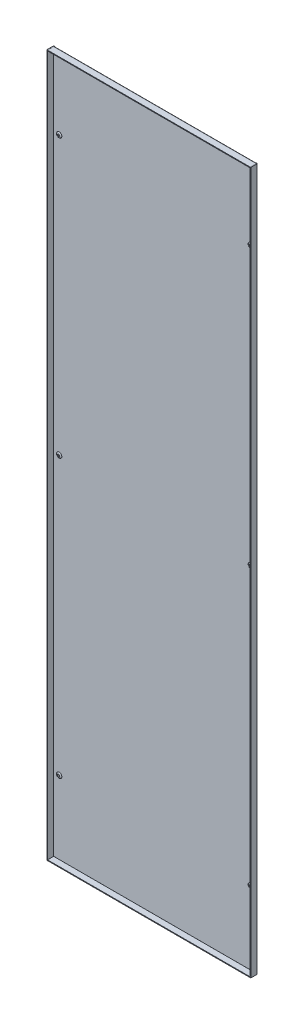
ISO-10303-21;
HEADER;
FILE_DESCRIPTION(('STEP AP214'),'2;1');
FILE_NAME('part.step','',(''),(''),'','','');
FILE_SCHEMA(('AUTOMOTIVE_DESIGN { 1 0 10303 214 1 1 1 1 }'));
ENDSEC;
DATA;
#1=APPLICATION_CONTEXT('core data for automotive mechanical design processes');
#2=APPLICATION_PROTOCOL_DEFINITION('international standard','automotive_design',2000,#1);
#3=PRODUCT_CONTEXT('',#1,'mechanical');
#4=PRODUCT('Part','Part','',(#3));
#5=PRODUCT_RELATED_PRODUCT_CATEGORY('part','',(#4));
#6=PRODUCT_DEFINITION_FORMATION('','',#4);
#7=PRODUCT_DEFINITION_CONTEXT('part definition',#1,'design');
#8=PRODUCT_DEFINITION('design','',#6,#7);
#9=PRODUCT_DEFINITION_SHAPE('','',#8);
#10=(LENGTH_UNIT() NAMED_UNIT(*) SI_UNIT(.MILLI.,.METRE.));
#11=(NAMED_UNIT(*) PLANE_ANGLE_UNIT() SI_UNIT($,.RADIAN.));
#12=(NAMED_UNIT(*) SI_UNIT($,.STERADIAN.) SOLID_ANGLE_UNIT());
#13=UNCERTAINTY_MEASURE_WITH_UNIT(LENGTH_MEASURE(1.E-05),#10,'distance_accuracy_value','');
#14=(GEOMETRIC_REPRESENTATION_CONTEXT(3) GLOBAL_UNCERTAINTY_ASSIGNED_CONTEXT((#13)) GLOBAL_UNIT_ASSIGNED_CONTEXT((#10,
#11,#12)) REPRESENTATION_CONTEXT('',''));
#15=CARTESIAN_POINT('',(0.,0.,0.));
#16=DIRECTION('',(0.,0.,1.));
#17=DIRECTION('',(1.,0.,0.));
#18=AXIS2_PLACEMENT_3D('',#15,#16,#17);
#19=CARTESIAN_POINT('',(285.,981.,2.));
#20=DIRECTION('',(0.,0.,-1.));
#21=DIRECTION('',(-1.,0.,0.));
#22=AXIS2_PLACEMENT_3D('',#19,#20,#21);
#23=PLANE('',#22);
#24=DIRECTION('',(1.,0.,0.));
#25=VECTOR('',#24,1.);
#26=CARTESIAN_POINT('',(282.95,-978.95,1.99999999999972));
#27=LINE('',#26,#25);
#28=CARTESIAN_POINT('',(282.95,-978.95,1.99999999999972));
#29=VERTEX_POINT('',#28);
#30=CARTESIAN_POINT('',(-282.95,-978.95,2.));
#31=VERTEX_POINT('',#30);
#32=EDGE_CURVE('E392',#29,#31,#27,.F.);
#33=ORIENTED_EDGE('',*,*,#32,.F.);
#34=DIRECTION('',(0.,1.,0.));
#35=VECTOR('',#34,1.);
#36=CARTESIAN_POINT('',(282.95,981.,2.00000000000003));
#37=LINE('',#36,#35);
#38=CARTESIAN_POINT('',(282.95,978.949999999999,1.99999999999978));
#39=VERTEX_POINT('',#38);
#40=EDGE_CURVE('E889',#39,#29,#37,.F.);
#41=ORIENTED_EDGE('',*,*,#40,.F.);
#42=DIRECTION('',(-1.,0.,0.));
#43=VECTOR('',#42,1.);
#44=CARTESIAN_POINT('',(-282.95,978.949999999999,1.99999999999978));
#45=LINE('',#44,#43);
#46=CARTESIAN_POINT('',(-282.95,978.949999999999,1.99999999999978));
#47=VERTEX_POINT('',#46);
#48=EDGE_CURVE('E448',#47,#39,#45,.F.);
#49=ORIENTED_EDGE('',*,*,#48,.F.);
#50=DIRECTION('',(0.,-1.,0.));
#51=VECTOR('',#50,1.);
#52=CARTESIAN_POINT('',(-282.95,-981.,2.));
#53=LINE('',#52,#51);
#54=EDGE_CURVE('E495',#31,#47,#53,.F.);
#55=ORIENTED_EDGE('',*,*,#54,.F.);
#56=EDGE_LOOP('',(#33,#41,#49,#55));
#57=FACE_BOUND('',#56,.T.);
#58=CARTESIAN_POINT('',(268.,774.999999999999,1.99999999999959));
#59=DIRECTION('',(0.,0.,1.));
#60=DIRECTION('',(1.,0.,0.));
#61=AXIS2_PLACEMENT_3D('',#58,#59,#60);
#62=CIRCLE('',#61,7.38035762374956);
#63=CARTESIAN_POINT('',(275.380357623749,774.999999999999,1.99999999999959));
#64=VERTEX_POINT('',#63);
#65=EDGE_CURVE('E532',#64,#64,#62,.T.);
#66=ORIENTED_EDGE('',*,*,#65,.F.);
#67=EDGE_LOOP('',(#66));
#68=FACE_BOUND('',#67,.T.);
#69=CARTESIAN_POINT('',(268.,-7.7715611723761E-13,2.00000000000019));
#70=DIRECTION('',(0.,0.,1.));
#71=DIRECTION('',(1.,0.,0.));
#72=AXIS2_PLACEMENT_3D('',#69,#70,#71);
#73=CIRCLE('',#72,7.38035762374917);
#74=CARTESIAN_POINT('',(275.380357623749,-7.7715611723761E-13,2.00000000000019));
#75=VERTEX_POINT('',#74);
#76=EDGE_CURVE('E535',#75,#75,#73,.T.);
#77=ORIENTED_EDGE('',*,*,#76,.F.);
#78=EDGE_LOOP('',(#77));
#79=FACE_BOUND('',#78,.T.);
#80=CARTESIAN_POINT('',(268.,-775.000000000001,2.00000000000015));
#81=DIRECTION('',(0.,0.,1.));
#82=DIRECTION('',(1.,0.,0.));
#83=AXIS2_PLACEMENT_3D('',#80,#81,#82);
#84=CIRCLE('',#83,7.38035762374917);
#85=CARTESIAN_POINT('',(275.380357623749,-775.000000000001,2.00000000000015));
#86=VERTEX_POINT('',#85);
#87=EDGE_CURVE('E538',#86,#86,#84,.T.);
#88=ORIENTED_EDGE('',*,*,#87,.F.);
#89=EDGE_LOOP('',(#88));
#90=FACE_BOUND('',#89,.T.);
#91=CARTESIAN_POINT('',(-267.5,774.999999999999,1.9999999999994));
#92=DIRECTION('',(0.,0.,1.));
#93=DIRECTION('',(1.,0.,0.));
#94=AXIS2_PLACEMENT_3D('',#91,#92,#93);
#95=CIRCLE('',#94,7.38035762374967);
#96=CARTESIAN_POINT('',(-260.11964237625,774.999999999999,1.9999999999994));
#97=VERTEX_POINT('',#96);
#98=EDGE_CURVE('E541',#97,#97,#95,.T.);
#99=ORIENTED_EDGE('',*,*,#98,.F.);
#100=EDGE_LOOP('',(#99));
#101=FACE_BOUND('',#100,.T.);
#102=CARTESIAN_POINT('',(-267.5,-7.7715611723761E-13,2.00000000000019));
#103=DIRECTION('',(0.,0.,1.));
#104=DIRECTION('',(1.,0.,0.));
#105=AXIS2_PLACEMENT_3D('',#102,#103,#104);
#106=CIRCLE('',#105,7.38035762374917);
#107=CARTESIAN_POINT('',(-260.119642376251,-7.7715611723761E-13,2.00000000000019));
#108=VERTEX_POINT('',#107);
#109=EDGE_CURVE('E122',#108,#108,#106,.T.);
#110=ORIENTED_EDGE('',*,*,#109,.F.);
#111=EDGE_LOOP('',(#110));
#112=FACE_BOUND('',#111,.T.);
#113=CARTESIAN_POINT('',(-267.5,-775.000000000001,1.99999999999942));
#114=DIRECTION('',(0.,0.,1.));
#115=DIRECTION('',(1.,0.,0.));
#116=AXIS2_PLACEMENT_3D('',#113,#114,#115);
#117=CIRCLE('',#116,7.38035762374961);
#118=CARTESIAN_POINT('',(-260.11964237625,-775.000000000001,1.99999999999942));
#119=VERTEX_POINT('',#118);
#120=EDGE_CURVE('E13',#119,#119,#117,.T.);
#121=ORIENTED_EDGE('',*,*,#120,.F.);
#122=EDGE_LOOP('',(#121));
#123=FACE_BOUND('',#122,.T.);
#124=ADVANCED_FACE('F114',(#57,#68,#79,#90,#101,#112,#123),#23,.F.);
#125=CARTESIAN_POINT('',(285.,981.,0.));
#126=DIRECTION('',(0.,0.,-1.));
#127=DIRECTION('',(-1.,0.,0.));
#128=AXIS2_PLACEMENT_3D('',#125,#126,#127);
#129=PLANE('',#128);
#130=CARTESIAN_POINT('',(-267.5,-7.7715611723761E-13,1.13664286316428E-10));
#131=DIRECTION('',(0.,0.,1.));
#132=DIRECTION('',(1.,0.,0.));
#133=AXIS2_PLACEMENT_3D('',#130,#131,#132);
#134=CIRCLE('',#133,6.);
#135=CARTESIAN_POINT('',(-261.5,-7.7715611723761E-13,1.13664286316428E-10));
#136=VERTEX_POINT('',#135);
#137=EDGE_CURVE('E613',#136,#136,#134,.T.);
#138=ORIENTED_EDGE('',*,*,#137,.T.);
#139=EDGE_LOOP('',(#138));
#140=FACE_BOUND('',#139,.T.);
#141=CARTESIAN_POINT('',(268.,-775.000000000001,1.13642602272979E-10));
#142=DIRECTION('',(0.,0.,1.));
#143=DIRECTION('',(1.,0.,0.));
#144=AXIS2_PLACEMENT_3D('',#141,#142,#143);
#145=CIRCLE('',#144,6.);
#146=CARTESIAN_POINT('',(274.,-775.000000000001,1.13642602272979E-10));
#147=VERTEX_POINT('',#146);
#148=EDGE_CURVE('E675',#147,#147,#145,.T.);
#149=ORIENTED_EDGE('',*,*,#148,.T.);
#150=EDGE_LOOP('',(#149));
#151=FACE_BOUND('',#150,.T.);
#152=CARTESIAN_POINT('',(268.,774.999999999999,1.13686837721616E-10));
#153=DIRECTION('',(0.,0.,1.));
#154=DIRECTION('',(1.,0.,0.));
#155=AXIS2_PLACEMENT_3D('',#152,#153,#154);
#156=CIRCLE('',#155,6.);
#157=CARTESIAN_POINT('',(274.,774.999999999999,1.13686837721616E-10));
#158=VERTEX_POINT('',#157);
#159=EDGE_CURVE('E373',#158,#158,#156,.T.);
#160=ORIENTED_EDGE('',*,*,#159,.T.);
#161=EDGE_LOOP('',(#160));
#162=FACE_BOUND('',#161,.T.);
#163=DIRECTION('',(0.,1.,0.));
#164=VECTOR('',#163,1.);
#165=CARTESIAN_POINT('',(282.95,981.,0.));
#166=LINE('',#165,#164);
#167=CARTESIAN_POINT('',(282.95,978.949999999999,-2.1987620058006E-13));
#168=VERTEX_POINT('',#167);
#169=CARTESIAN_POINT('',(282.95,-978.95,-2.75821032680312E-13));
#170=VERTEX_POINT('',#169);
#171=EDGE_CURVE('E911',#168,#170,#166,.F.);
#172=ORIENTED_EDGE('',*,*,#171,.T.);
#173=DIRECTION('',(1.,0.,0.));
#174=VECTOR('',#173,1.);
#175=CARTESIAN_POINT('',(282.95,-978.95,-2.75821032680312E-13));
#176=LINE('',#175,#174);
#177=CARTESIAN_POINT('',(-282.95,-978.95,-2.75821032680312E-13));
#178=VERTEX_POINT('',#177);
#179=EDGE_CURVE('E374',#170,#178,#176,.F.);
#180=ORIENTED_EDGE('',*,*,#179,.T.);
#181=DIRECTION('',(0.,-1.,0.));
#182=VECTOR('',#181,1.);
#183=CARTESIAN_POINT('',(-282.95,-981.,0.));
#184=LINE('',#183,#182);
#185=CARTESIAN_POINT('',(-282.95,978.949999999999,-2.1987620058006E-13));
#186=VERTEX_POINT('',#185);
#187=EDGE_CURVE('E490',#178,#186,#184,.F.);
#188=ORIENTED_EDGE('',*,*,#187,.T.);
#189=DIRECTION('',(-1.,0.,0.));
#190=VECTOR('',#189,1.);
#191=CARTESIAN_POINT('',(-282.95,978.949999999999,-2.1987620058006E-13));
#192=LINE('',#191,#190);
#193=EDGE_CURVE('E431',#186,#168,#192,.F.);
#194=ORIENTED_EDGE('',*,*,#193,.T.);
#195=EDGE_LOOP('',(#172,#180,#188,#194));
#196=FACE_BOUND('',#195,.T.);
#197=CARTESIAN_POINT('',(268.,-7.7715611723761E-13,1.13664286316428E-10));
#198=DIRECTION('',(0.,0.,1.));
#199=DIRECTION('',(1.,0.,0.));
#200=AXIS2_PLACEMENT_3D('',#197,#198,#199);
#201=CIRCLE('',#200,6.);
#202=CARTESIAN_POINT('',(274.,-7.7715611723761E-13,1.13664286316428E-10));
#203=VERTEX_POINT('',#202);
#204=EDGE_CURVE('E706',#203,#203,#201,.T.);
#205=ORIENTED_EDGE('',*,*,#204,.T.);
#206=EDGE_LOOP('',(#205));
#207=FACE_BOUND('',#206,.T.);
#208=CARTESIAN_POINT('',(-267.5,774.999999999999,1.13686837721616E-10));
#209=DIRECTION('',(0.,0.,1.));
#210=DIRECTION('',(1.,0.,0.));
#211=AXIS2_PLACEMENT_3D('',#208,#209,#210);
#212=CIRCLE('',#211,6.);
#213=CARTESIAN_POINT('',(-261.5,774.999999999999,1.13686837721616E-10));
#214=VERTEX_POINT('',#213);
#215=EDGE_CURVE('E644',#214,#214,#212,.T.);
#216=ORIENTED_EDGE('',*,*,#215,.T.);
#217=EDGE_LOOP('',(#216));
#218=FACE_BOUND('',#217,.T.);
#219=CARTESIAN_POINT('',(-267.5,-775.000000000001,1.13642602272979E-10));
#220=DIRECTION('',(0.,0.,1.));
#221=DIRECTION('',(1.,0.,0.));
#222=AXIS2_PLACEMENT_3D('',#219,#220,#221);
#223=CIRCLE('',#222,6.);
#224=CARTESIAN_POINT('',(-261.5,-775.000000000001,1.13642602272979E-10));
#225=VERTEX_POINT('',#224);
#226=EDGE_CURVE('E586',#225,#225,#223,.T.);
#227=ORIENTED_EDGE('',*,*,#226,.T.);
#228=EDGE_LOOP('',(#227));
#229=FACE_BOUND('',#228,.T.);
#230=ADVANCED_FACE('F116',(#140,#151,#162,#196,#207,#218,#229),#129,.T.);
#231=CARTESIAN_POINT('',(282.95,-980.999999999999,2.00000000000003));
#232=DIRECTION('',(-1.,0.,0.));
#233=DIRECTION('',(0.,0.,1.));
#234=AXIS2_PLACEMENT_3D('',#231,#232,#233);
#235=PLANE('',#234);
#236=DIRECTION('',(0.,-8.88178419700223E-12,-1.));
#237=VECTOR('',#236,1.);
#238=CARTESIAN_POINT('',(282.95,-980.999999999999,2.00000000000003));
#239=LINE('',#238,#237);
#240=CARTESIAN_POINT('',(282.95,-980.999390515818,2.00001486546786));
#241=VERTEX_POINT('',#240);
#242=CARTESIAN_POINT('',(282.95,-980.999999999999,0.));
#243=VERTEX_POINT('',#242);
#244=EDGE_CURVE('E516',#241,#243,#239,.T.);
#245=ORIENTED_EDGE('',*,*,#244,.F.);
#246=CARTESIAN_POINT('',(282.95,-978.95,2.05000000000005));
#247=DIRECTION('',(1.,0.,0.));
#248=DIRECTION('',(0.,0.,-1.));
#249=AXIS2_PLACEMENT_3D('',#246,#247,#248);
#250=CIRCLE('',#249,2.05000000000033);
#251=EDGE_CURVE('E529',#241,#170,#250,.T.);
#252=ORIENTED_EDGE('',*,*,#251,.T.);
#253=DIRECTION('',(0.,1.,0.));
#254=VECTOR('',#253,1.);
#255=CARTESIAN_POINT('',(282.95,981.,0.));
#256=LINE('',#255,#254);
#257=EDGE_CURVE('E457',#243,#170,#256,.T.);
#258=ORIENTED_EDGE('',*,*,#257,.F.);
#259=EDGE_LOOP('',(#245,#252,#258));
#260=FACE_BOUND('',#259,.T.);
#261=ADVANCED_FACE('F810',(#260),#235,.T.);
#262=CARTESIAN_POINT('',(-282.95,-978.95,1.99999999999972));
#263=DIRECTION('',(1.,0.,0.));
#264=DIRECTION('',(0.,0.,-1.));
#265=AXIS2_PLACEMENT_3D('',#262,#263,#264);
#266=PLANE('',#265);
#267=CARTESIAN_POINT('',(-282.95,-981.,0.));
#268=VERTEX_POINT('',#267);
#269=EDGE_CURVE('E486',#268,#178,#184,.F.);
#270=ORIENTED_EDGE('',*,*,#269,.T.);
#271=CARTESIAN_POINT('',(-282.95,-978.95,2.05000000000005));
#272=DIRECTION('',(1.,0.,0.));
#273=DIRECTION('',(0.,0.,-1.));
#274=AXIS2_PLACEMENT_3D('',#271,#272,#273);
#275=CIRCLE('',#274,2.05000000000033);
#276=CARTESIAN_POINT('',(-282.95,-980.999390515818,2.00001486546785));
#277=VERTEX_POINT('',#276);
#278=EDGE_CURVE('E385',#178,#277,#275,.F.);
#279=ORIENTED_EDGE('',*,*,#278,.T.);
#280=DIRECTION('',(0.,0.,-1.));
#281=VECTOR('',#280,1.);
#282=CARTESIAN_POINT('',(-282.95,-981.,2.));
#283=LINE('',#282,#281);
#284=EDGE_CURVE('E492',#277,#268,#283,.T.);
#285=ORIENTED_EDGE('',*,*,#284,.T.);
#286=EDGE_LOOP('',(#270,#279,#285));
#287=FACE_BOUND('',#286,.T.);
#288=ADVANCED_FACE('F806',(#287),#266,.T.);
#289=CARTESIAN_POINT('',(-282.95,980.999999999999,2.));
#290=DIRECTION('',(1.,0.,0.));
#291=DIRECTION('',(0.,0.,-1.));
#292=AXIS2_PLACEMENT_3D('',#289,#290,#291);
#293=PLANE('',#292);
#294=DIRECTION('',(0.,8.88178419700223E-12,-1.));
#295=VECTOR('',#294,1.);
#296=CARTESIAN_POINT('',(-282.95,980.999999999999,2.));
#297=LINE('',#296,#295);
#298=CARTESIAN_POINT('',(-282.95,980.999390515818,2.00001486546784));
#299=VERTEX_POINT('',#298);
#300=CARTESIAN_POINT('',(-282.95,980.999999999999,0.));
#301=VERTEX_POINT('',#300);
#302=EDGE_CURVE('E509',#299,#301,#297,.T.);
#303=ORIENTED_EDGE('',*,*,#302,.F.);
#304=CARTESIAN_POINT('',(-282.95,978.949999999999,2.05));
#305=DIRECTION('',(-1.,0.,0.));
#306=DIRECTION('',(0.,0.,1.));
#307=AXIS2_PLACEMENT_3D('',#304,#305,#306);
#308=CIRCLE('',#307,2.05000000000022);
#309=EDGE_CURVE('E506',#299,#186,#308,.T.);
#310=ORIENTED_EDGE('',*,*,#309,.T.);
#311=DIRECTION('',(0.,-1.,0.));
#312=VECTOR('',#311,1.);
#313=CARTESIAN_POINT('',(-282.95,-981.,0.));
#314=LINE('',#313,#312);
#315=EDGE_CURVE('E243',#301,#186,#314,.T.);
#316=ORIENTED_EDGE('',*,*,#315,.F.);
#317=EDGE_LOOP('',(#303,#310,#316));
#318=FACE_BOUND('',#317,.T.);
#319=ADVANCED_FACE('F809',(#318),#293,.T.);
#320=CARTESIAN_POINT('',(282.95,978.949999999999,1.99999999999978));
#321=DIRECTION('',(-1.,0.,0.));
#322=DIRECTION('',(0.,0.,1.));
#323=AXIS2_PLACEMENT_3D('',#320,#321,#322);
#324=PLANE('',#323);
#325=CARTESIAN_POINT('',(282.95,981.,0.));
#326=VERTEX_POINT('',#325);
#327=EDGE_CURVE('E908',#326,#168,#166,.F.);
#328=ORIENTED_EDGE('',*,*,#327,.T.);
#329=CARTESIAN_POINT('',(282.95,978.949999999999,2.05));
#330=DIRECTION('',(-1.,0.,0.));
#331=DIRECTION('',(0.,0.,1.));
#332=AXIS2_PLACEMENT_3D('',#329,#330,#331);
#333=CIRCLE('',#332,2.05000000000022);
#334=CARTESIAN_POINT('',(282.95,980.999390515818,2.00001486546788));
#335=VERTEX_POINT('',#334);
#336=EDGE_CURVE('E442',#168,#335,#333,.F.);
#337=ORIENTED_EDGE('',*,*,#336,.T.);
#338=DIRECTION('',(0.,0.,-1.));
#339=VECTOR('',#338,1.);
#340=CARTESIAN_POINT('',(282.95,981.,2.00000000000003));
#341=LINE('',#340,#339);
#342=EDGE_CURVE('E236',#335,#326,#341,.T.);
#343=ORIENTED_EDGE('',*,*,#342,.T.);
#344=EDGE_LOOP('',(#328,#337,#343));
#345=FACE_BOUND('',#344,.T.);
#346=ADVANCED_FACE('F815',(#345),#324,.T.);
#347=CARTESIAN_POINT('',(282.95,-980.999999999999,2.05000000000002));
#348=DIRECTION('',(0.,-1.,0.));
#349=DIRECTION('',(0.,0.,-1.));
#350=AXIS2_PLACEMENT_3D('',#347,#348,#349);
#351=PLANE('',#350);
#352=DIRECTION('',(-1.,0.,0.));
#353=VECTOR('',#352,1.);
#354=CARTESIAN_POINT('',(285.,-981.,2.04999999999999));
#355=LINE('',#354,#353);
#356=CARTESIAN_POINT('',(283.,-980.999999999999,2.05000000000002));
#357=VERTEX_POINT('',#356);
#358=CARTESIAN_POINT('',(285.,-980.999999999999,2.05000000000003));
#359=VERTEX_POINT('',#358);
#360=EDGE_CURVE('E151',#357,#359,#355,.F.);
#361=ORIENTED_EDGE('',*,*,#360,.F.);
#362=CARTESIAN_POINT('',(282.95,-980.999999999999,2.05000000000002));
#363=DIRECTION('',(0.,1.,0.));
#364=DIRECTION('',(0.,0.,1.));
#365=AXIS2_PLACEMENT_3D('',#362,#363,#364);
#366=CIRCLE('',#365,0.0499999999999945);
#367=EDGE_CURVE('E524',#241,#357,#366,.F.);
#368=ORIENTED_EDGE('',*,*,#367,.F.);
#369=ORIENTED_EDGE('',*,*,#244,.T.);
#370=CARTESIAN_POINT('',(282.95,-980.999999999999,2.05000000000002));
#371=DIRECTION('',(0.,1.,0.));
#372=DIRECTION('',(0.,0.,1.));
#373=AXIS2_PLACEMENT_3D('',#370,#371,#372);
#374=CIRCLE('',#373,2.04999999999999);
#375=EDGE_CURVE('E910',#243,#359,#374,.F.);
#376=ORIENTED_EDGE('',*,*,#375,.T.);
#377=EDGE_LOOP('',(#361,#368,#369,#376));
#378=FACE_BOUND('',#377,.T.);
#379=ADVANCED_FACE('F818',(#378),#351,.T.);
#380=CARTESIAN_POINT('',(282.95,981.,2.05000000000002));
#381=DIRECTION('',(0.,-1.,0.));
#382=DIRECTION('',(0.,0.,-1.));
#383=AXIS2_PLACEMENT_3D('',#380,#381,#382);
#384=PLANE('',#383);
#385=CARTESIAN_POINT('',(282.95,981.,2.05000000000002));
#386=DIRECTION('',(0.,1.,0.));
#387=DIRECTION('',(0.,0.,1.));
#388=AXIS2_PLACEMENT_3D('',#385,#386,#387);
#389=CIRCLE('',#388,0.0499999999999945);
#390=CARTESIAN_POINT('',(283.,981.,2.05000000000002));
#391=VERTEX_POINT('',#390);
#392=EDGE_CURVE('E886',#391,#335,#389,.T.);
#393=ORIENTED_EDGE('',*,*,#392,.F.);
#394=DIRECTION('',(-1.,0.,0.));
#395=VECTOR('',#394,1.);
#396=CARTESIAN_POINT('',(283.,981.,2.05000000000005));
#397=LINE('',#396,#395);
#398=CARTESIAN_POINT('',(285.,981.,2.05000000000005));
#399=VERTEX_POINT('',#398);
#400=EDGE_CURVE('E887',#391,#399,#397,.F.);
#401=ORIENTED_EDGE('',*,*,#400,.T.);
#402=CARTESIAN_POINT('',(282.95,981.,2.05000000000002));
#403=DIRECTION('',(0.,1.,0.));
#404=DIRECTION('',(0.,0.,1.));
#405=AXIS2_PLACEMENT_3D('',#402,#403,#404);
#406=CIRCLE('',#405,2.04999999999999);
#407=EDGE_CURVE('E180',#399,#326,#406,.T.);
#408=ORIENTED_EDGE('',*,*,#407,.T.);
#409=ORIENTED_EDGE('',*,*,#342,.F.);
#410=EDGE_LOOP('',(#393,#401,#408,#409));
#411=FACE_BOUND('',#410,.T.);
#412=ADVANCED_FACE('F874',(#411),#384,.F.);
#413=CARTESIAN_POINT('',(282.95,981.,2.05000000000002));
#414=DIRECTION('',(0.,1.,0.));
#415=DIRECTION('',(1.,0.,0.));
#416=AXIS2_PLACEMENT_3D('',#413,#414,#415);
#417=CYLINDRICAL_SURFACE('',#416,2.04999999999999);
#418=ORIENTED_EDGE('',*,*,#327,.F.);
#419=ORIENTED_EDGE('',*,*,#407,.F.);
#420=DIRECTION('',(0.,1.,0.));
#421=VECTOR('',#420,1.);
#422=CARTESIAN_POINT('',(285.,-981.,2.04999999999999));
#423=LINE('',#422,#421);
#424=EDGE_CURVE('E138',#399,#359,#423,.F.);
#425=ORIENTED_EDGE('',*,*,#424,.T.);
#426=ORIENTED_EDGE('',*,*,#375,.F.);
#427=ORIENTED_EDGE('',*,*,#257,.T.);
#428=ORIENTED_EDGE('',*,*,#171,.F.);
#429=EDGE_LOOP('',(#418,#419,#425,#426,#427,#428));
#430=FACE_BOUND('',#429,.T.);
#431=ADVANCED_FACE('F871',(#430),#417,.T.);
#432=CARTESIAN_POINT('',(282.95,981.,2.05000000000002));
#433=DIRECTION('',(0.,1.,0.));
#434=DIRECTION('',(1.,0.,0.));
#435=AXIS2_PLACEMENT_3D('',#432,#433,#434);
#436=CYLINDRICAL_SURFACE('',#435,0.0499999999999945);
#437=EDGE_CURVE('E526',#335,#39,#37,.F.);
#438=ORIENTED_EDGE('',*,*,#437,.T.);
#439=ORIENTED_EDGE('',*,*,#40,.T.);
#440=DIRECTION('',(0.,1.,-1.48932356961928E-13));
#441=VECTOR('',#440,1.);
#442=CARTESIAN_POINT('',(282.95,-980.999999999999,2.00000000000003));
#443=LINE('',#442,#441);
#444=EDGE_CURVE('E461',#241,#29,#443,.T.);
#445=ORIENTED_EDGE('',*,*,#444,.F.);
#446=ORIENTED_EDGE('',*,*,#367,.T.);
#447=DIRECTION('',(0.,1.,0.));
#448=VECTOR('',#447,1.);
#449=CARTESIAN_POINT('',(283.,-981.,2.05));
#450=LINE('',#449,#448);
#451=EDGE_CURVE('E893',#357,#391,#450,.T.);
#452=ORIENTED_EDGE('',*,*,#451,.T.);
#453=ORIENTED_EDGE('',*,*,#392,.T.);
#454=EDGE_LOOP('',(#438,#439,#445,#446,#452,#453));
#455=FACE_BOUND('',#454,.T.);
#456=ADVANCED_FACE('F870',(#455),#436,.F.);
#457=CARTESIAN_POINT('',(285.,981.,19.));
#458=DIRECTION('',(0.,-1.,0.));
#459=DIRECTION('',(0.,0.,-1.));
#460=AXIS2_PLACEMENT_3D('',#457,#458,#459);
#461=PLANE('',#460);
#462=ORIENTED_EDGE('',*,*,#400,.F.);
#463=DIRECTION('',(0.,0.,-1.));
#464=VECTOR('',#463,1.);
#465=CARTESIAN_POINT('',(283.,981.,19.));
#466=LINE('',#465,#464);
#467=CARTESIAN_POINT('',(283.,981.,19.));
#468=VERTEX_POINT('',#467);
#469=EDGE_CURVE('E175',#391,#468,#466,.F.);
#470=ORIENTED_EDGE('',*,*,#469,.T.);
#471=DIRECTION('',(-1.,0.,0.));
#472=VECTOR('',#471,1.);
#473=CARTESIAN_POINT('',(285.,981.,19.));
#474=LINE('',#473,#472);
#475=CARTESIAN_POINT('',(285.,981.,19.));
#476=VERTEX_POINT('',#475);
#477=EDGE_CURVE('E500',#476,#468,#474,.T.);
#478=ORIENTED_EDGE('',*,*,#477,.F.);
#479=DIRECTION('',(0.,0.,1.));
#480=VECTOR('',#479,1.);
#481=CARTESIAN_POINT('',(285.,981.,1.99999999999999));
#482=LINE('',#481,#480);
#483=EDGE_CURVE('E892',#399,#476,#482,.T.);
#484=ORIENTED_EDGE('',*,*,#483,.F.);
#485=EDGE_LOOP('',(#462,#470,#478,#484));
#486=FACE_BOUND('',#485,.T.);
#487=ADVANCED_FACE('F863',(#486),#461,.F.);
#488=CARTESIAN_POINT('',(285.,-981.,1.99999999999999));
#489=DIRECTION('',(0.,1.,0.));
#490=DIRECTION('',(0.,0.,1.));
#491=AXIS2_PLACEMENT_3D('',#488,#489,#490);
#492=PLANE('',#491);
#493=ORIENTED_EDGE('',*,*,#360,.T.);
#494=DIRECTION('',(0.,0.,-1.));
#495=VECTOR('',#494,1.);
#496=CARTESIAN_POINT('',(285.,-981.,1.99999999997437));
#497=LINE('',#496,#495);
#498=CARTESIAN_POINT('',(285.,-981.,19.));
#499=VERTEX_POINT('',#498);
#500=EDGE_CURVE('E970',#499,#359,#497,.T.);
#501=ORIENTED_EDGE('',*,*,#500,.F.);
#502=DIRECTION('',(-1.,0.,0.));
#503=VECTOR('',#502,1.);
#504=CARTESIAN_POINT('',(285.,-981.,19.));
#505=LINE('',#504,#503);
#506=CARTESIAN_POINT('',(283.,-981.,19.));
#507=VERTEX_POINT('',#506);
#508=EDGE_CURVE('E971',#499,#507,#505,.T.);
#509=ORIENTED_EDGE('',*,*,#508,.T.);
#510=DIRECTION('',(0.,0.,1.));
#511=VECTOR('',#510,1.);
#512=CARTESIAN_POINT('',(283.,-981.,2.));
#513=LINE('',#512,#511);
#514=EDGE_CURVE('E901',#507,#357,#513,.F.);
#515=ORIENTED_EDGE('',*,*,#514,.T.);
#516=EDGE_LOOP('',(#493,#501,#509,#515));
#517=FACE_BOUND('',#516,.T.);
#518=ADVANCED_FACE('F857',(#517),#492,.F.);
#519=CARTESIAN_POINT('',(285.,981.,1.99999999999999));
#520=DIRECTION('',(-1.,0.,0.));
#521=DIRECTION('',(0.,0.,1.));
#522=AXIS2_PLACEMENT_3D('',#519,#520,#521);
#523=PLANE('',#522);
#524=ORIENTED_EDGE('',*,*,#424,.F.);
#525=ORIENTED_EDGE('',*,*,#483,.T.);
#526=DIRECTION('',(0.,-1.,0.));
#527=VECTOR('',#526,1.);
#528=CARTESIAN_POINT('',(285.,981.,19.));
#529=LINE('',#528,#527);
#530=EDGE_CURVE('E160',#476,#499,#529,.T.);
#531=ORIENTED_EDGE('',*,*,#530,.T.);
#532=ORIENTED_EDGE('',*,*,#500,.T.);
#533=EDGE_LOOP('',(#524,#525,#531,#532));
#534=FACE_BOUND('',#533,.T.);
#535=ADVANCED_FACE('F853',(#534),#523,.F.);
#536=CARTESIAN_POINT('',(283.,981.,2.));
#537=DIRECTION('',(-1.,0.,0.));
#538=DIRECTION('',(0.,0.,1.));
#539=AXIS2_PLACEMENT_3D('',#536,#537,#538);
#540=PLANE('',#539);
#541=ORIENTED_EDGE('',*,*,#469,.F.);
#542=ORIENTED_EDGE('',*,*,#451,.F.);
#543=ORIENTED_EDGE('',*,*,#514,.F.);
#544=DIRECTION('',(0.,1.,0.));
#545=VECTOR('',#544,1.);
#546=CARTESIAN_POINT('',(283.,-981.,19.));
#547=LINE('',#546,#545);
#548=EDGE_CURVE('E899',#468,#507,#547,.F.);
#549=ORIENTED_EDGE('',*,*,#548,.F.);
#550=EDGE_LOOP('',(#541,#542,#543,#549));
#551=FACE_BOUND('',#550,.T.);
#552=ADVANCED_FACE('F856',(#551),#540,.T.);
#553=CARTESIAN_POINT('',(285.,-981.,19.));
#554=DIRECTION('',(0.,0.,-1.));
#555=DIRECTION('',(-1.,0.,0.));
#556=AXIS2_PLACEMENT_3D('',#553,#554,#555);
#557=PLANE('',#556);
#558=ORIENTED_EDGE('',*,*,#548,.T.);
#559=ORIENTED_EDGE('',*,*,#508,.F.);
#560=ORIENTED_EDGE('',*,*,#530,.F.);
#561=ORIENTED_EDGE('',*,*,#477,.T.);
#562=EDGE_LOOP('',(#558,#559,#560,#561));
#563=FACE_BOUND('',#562,.T.);
#564=ADVANCED_FACE('F849',(#563),#557,.F.);
#565=CARTESIAN_POINT('',(-282.95,980.999999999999,2.05));
#566=DIRECTION('',(0.,1.,0.));
#567=DIRECTION('',(0.,0.,1.));
#568=AXIS2_PLACEMENT_3D('',#565,#566,#567);
#569=PLANE('',#568);
#570=DIRECTION('',(1.,0.,0.));
#571=VECTOR('',#570,1.);
#572=CARTESIAN_POINT('',(-285.,981.,2.04999999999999));
#573=LINE('',#572,#571);
#574=CARTESIAN_POINT('',(-283.,980.999999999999,2.05));
#575=VERTEX_POINT('',#574);
#576=CARTESIAN_POINT('',(-285.,980.999999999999,2.05));
#577=VERTEX_POINT('',#576);
#578=EDGE_CURVE('E200',#575,#577,#573,.F.);
#579=ORIENTED_EDGE('',*,*,#578,.F.);
#580=CARTESIAN_POINT('',(-282.95,980.999999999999,2.05));
#581=DIRECTION('',(0.,-1.,0.));
#582=DIRECTION('',(0.,0.,-1.));
#583=AXIS2_PLACEMENT_3D('',#580,#581,#582);
#584=CIRCLE('',#583,0.0499999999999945);
#585=EDGE_CURVE('E494',#299,#575,#584,.F.);
#586=ORIENTED_EDGE('',*,*,#585,.F.);
#587=ORIENTED_EDGE('',*,*,#302,.T.);
#588=CARTESIAN_POINT('',(-282.95,980.999999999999,2.05));
#589=DIRECTION('',(0.,-1.,0.));
#590=DIRECTION('',(0.,0.,-1.));
#591=AXIS2_PLACEMENT_3D('',#588,#589,#590);
#592=CIRCLE('',#591,2.04999999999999);
#593=EDGE_CURVE('E489',#301,#577,#592,.F.);
#594=ORIENTED_EDGE('',*,*,#593,.T.);
#595=EDGE_LOOP('',(#579,#586,#587,#594));
#596=FACE_BOUND('',#595,.T.);
#597=ADVANCED_FACE('F843',(#596),#569,.T.);
#598=CARTESIAN_POINT('',(-282.95,-981.,2.05));
#599=DIRECTION('',(0.,1.,0.));
#600=DIRECTION('',(0.,0.,1.));
#601=AXIS2_PLACEMENT_3D('',#598,#599,#600);
#602=PLANE('',#601);
#603=CARTESIAN_POINT('',(-282.95,-981.,2.05));
#604=DIRECTION('',(0.,-1.,0.));
#605=DIRECTION('',(0.,0.,-1.));
#606=AXIS2_PLACEMENT_3D('',#603,#604,#605);
#607=CIRCLE('',#606,0.0499999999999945);
#608=CARTESIAN_POINT('',(-283.,-981.,2.05));
#609=VERTEX_POINT('',#608);
#610=EDGE_CURVE('E465',#609,#277,#607,.T.);
#611=ORIENTED_EDGE('',*,*,#610,.F.);
#612=DIRECTION('',(1.,0.,0.));
#613=VECTOR('',#612,1.);
#614=CARTESIAN_POINT('',(-283.,-981.,2.05));
#615=LINE('',#614,#613);
#616=CARTESIAN_POINT('',(-285.,-981.,2.04999999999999));
#617=VERTEX_POINT('',#616);
#618=EDGE_CURVE('E481',#609,#617,#615,.F.);
#619=ORIENTED_EDGE('',*,*,#618,.T.);
#620=CARTESIAN_POINT('',(-282.95,-981.,2.05));
#621=DIRECTION('',(0.,-1.,0.));
#622=DIRECTION('',(0.,0.,-1.));
#623=AXIS2_PLACEMENT_3D('',#620,#621,#622);
#624=CIRCLE('',#623,2.04999999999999);
#625=EDGE_CURVE('E228',#617,#268,#624,.T.);
#626=ORIENTED_EDGE('',*,*,#625,.T.);
#627=ORIENTED_EDGE('',*,*,#284,.F.);
#628=EDGE_LOOP('',(#611,#619,#626,#627));
#629=FACE_BOUND('',#628,.T.);
#630=ADVANCED_FACE('F842',(#629),#602,.F.);
#631=CARTESIAN_POINT('',(-282.95,-981.,2.05));
#632=DIRECTION('',(0.,-1.,0.));
#633=DIRECTION('',(-1.,0.,0.));
#634=AXIS2_PLACEMENT_3D('',#631,#632,#633);
#635=CYLINDRICAL_SURFACE('',#634,2.04999999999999);
#636=ORIENTED_EDGE('',*,*,#269,.F.);
#637=ORIENTED_EDGE('',*,*,#625,.F.);
#638=DIRECTION('',(0.,-1.,0.));
#639=VECTOR('',#638,1.);
#640=CARTESIAN_POINT('',(-285.,981.,2.04999999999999));
#641=LINE('',#640,#639);
#642=EDGE_CURVE('E188',#617,#577,#641,.F.);
#643=ORIENTED_EDGE('',*,*,#642,.T.);
#644=ORIENTED_EDGE('',*,*,#593,.F.);
#645=ORIENTED_EDGE('',*,*,#315,.T.);
#646=ORIENTED_EDGE('',*,*,#187,.F.);
#647=EDGE_LOOP('',(#636,#637,#643,#644,#645,#646));
#648=FACE_BOUND('',#647,.T.);
#649=ADVANCED_FACE('F839',(#648),#635,.T.);
#650=CARTESIAN_POINT('',(-282.95,-981.,2.05));
#651=DIRECTION('',(0.,-1.,0.));
#652=DIRECTION('',(-1.,0.,0.));
#653=AXIS2_PLACEMENT_3D('',#650,#651,#652);
#654=CYLINDRICAL_SURFACE('',#653,0.0499999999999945);
#655=EDGE_CURVE('E499',#277,#31,#53,.F.);
#656=ORIENTED_EDGE('',*,*,#655,.T.);
#657=ORIENTED_EDGE('',*,*,#54,.T.);
#658=DIRECTION('',(0.,-1.,-1.08102889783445E-13));
#659=VECTOR('',#658,1.);
#660=CARTESIAN_POINT('',(-282.95,980.999999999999,2.));
#661=LINE('',#660,#659);
#662=EDGE_CURVE('E460',#299,#47,#661,.T.);
#663=ORIENTED_EDGE('',*,*,#662,.F.);
#664=ORIENTED_EDGE('',*,*,#585,.T.);
#665=DIRECTION('',(0.,-1.,0.));
#666=VECTOR('',#665,1.);
#667=CARTESIAN_POINT('',(-283.,981.,2.05));
#668=LINE('',#667,#666);
#669=EDGE_CURVE('E483',#575,#609,#668,.T.);
#670=ORIENTED_EDGE('',*,*,#669,.T.);
#671=ORIENTED_EDGE('',*,*,#610,.T.);
#672=EDGE_LOOP('',(#656,#657,#663,#664,#670,#671));
#673=FACE_BOUND('',#672,.T.);
#674=ADVANCED_FACE('F837',(#673),#654,.F.);
#675=CARTESIAN_POINT('',(-285.,981.,1.99999999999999));
#676=DIRECTION('',(0.,-1.,0.));
#677=DIRECTION('',(0.,0.,-1.));
#678=AXIS2_PLACEMENT_3D('',#675,#676,#677);
#679=PLANE('',#678);
#680=ORIENTED_EDGE('',*,*,#578,.T.);
#681=DIRECTION('',(0.,0.,-1.));
#682=VECTOR('',#681,1.);
#683=CARTESIAN_POINT('',(-285.,981.,19.));
#684=LINE('',#683,#682);
#685=CARTESIAN_POINT('',(-285.,981.,19.));
#686=VERTEX_POINT('',#685);
#687=EDGE_CURVE('E472',#686,#577,#684,.T.);
#688=ORIENTED_EDGE('',*,*,#687,.F.);
#689=DIRECTION('',(1.,0.,0.));
#690=VECTOR('',#689,1.);
#691=CARTESIAN_POINT('',(-285.,981.,19.));
#692=LINE('',#691,#690);
#693=CARTESIAN_POINT('',(-283.,981.,19.));
#694=VERTEX_POINT('',#693);
#695=EDGE_CURVE('E466',#686,#694,#692,.T.);
#696=ORIENTED_EDGE('',*,*,#695,.T.);
#697=DIRECTION('',(0.,0.,1.));
#698=VECTOR('',#697,1.);
#699=CARTESIAN_POINT('',(-283.,981.,2.));
#700=LINE('',#699,#698);
#701=EDGE_CURVE('E477',#694,#575,#700,.F.);
#702=ORIENTED_EDGE('',*,*,#701,.T.);
#703=EDGE_LOOP('',(#680,#688,#696,#702));
#704=FACE_BOUND('',#703,.T.);
#705=ADVANCED_FACE('F834',(#704),#679,.F.);
#706=CARTESIAN_POINT('',(-285.,-981.,19.));
#707=DIRECTION('',(0.,1.,0.));
#708=DIRECTION('',(0.,0.,1.));
#709=AXIS2_PLACEMENT_3D('',#706,#707,#708);
#710=PLANE('',#709);
#711=ORIENTED_EDGE('',*,*,#618,.F.);
#712=DIRECTION('',(0.,0.,-1.));
#713=VECTOR('',#712,1.);
#714=CARTESIAN_POINT('',(-283.,-981.,19.));
#715=LINE('',#714,#713);
#716=CARTESIAN_POINT('',(-283.,-981.,19.));
#717=VERTEX_POINT('',#716);
#718=EDGE_CURVE('E224',#609,#717,#715,.F.);
#719=ORIENTED_EDGE('',*,*,#718,.T.);
#720=DIRECTION('',(1.,0.,0.));
#721=VECTOR('',#720,1.);
#722=CARTESIAN_POINT('',(-285.,-981.,19.));
#723=LINE('',#722,#721);
#724=CARTESIAN_POINT('',(-285.,-981.,19.));
#725=VERTEX_POINT('',#724);
#726=EDGE_CURVE('E463',#725,#717,#723,.T.);
#727=ORIENTED_EDGE('',*,*,#726,.F.);
#728=DIRECTION('',(0.,0.,1.));
#729=VECTOR('',#728,1.);
#730=CARTESIAN_POINT('',(-285.,-981.,18.9999999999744));
#731=LINE('',#730,#729);
#732=EDGE_CURVE('E470',#617,#725,#731,.T.);
#733=ORIENTED_EDGE('',*,*,#732,.F.);
#734=EDGE_LOOP('',(#711,#719,#727,#733));
#735=FACE_BOUND('',#734,.T.);
#736=ADVANCED_FACE('F825',(#735),#710,.F.);
#737=CARTESIAN_POINT('',(-285.,981.,19.));
#738=DIRECTION('',(1.,0.,0.));
#739=DIRECTION('',(0.,0.,-1.));
#740=AXIS2_PLACEMENT_3D('',#737,#738,#739);
#741=PLANE('',#740);
#742=ORIENTED_EDGE('',*,*,#642,.F.);
#743=ORIENTED_EDGE('',*,*,#732,.T.);
#744=DIRECTION('',(0.,1.,0.));
#745=VECTOR('',#744,1.);
#746=CARTESIAN_POINT('',(-285.,981.,19.));
#747=LINE('',#746,#745);
#748=EDGE_CURVE('E209',#725,#686,#747,.T.);
#749=ORIENTED_EDGE('',*,*,#748,.T.);
#750=ORIENTED_EDGE('',*,*,#687,.T.);
#751=EDGE_LOOP('',(#742,#743,#749,#750));
#752=FACE_BOUND('',#751,.T.);
#753=ADVANCED_FACE('F821',(#752),#741,.F.);
#754=CARTESIAN_POINT('',(-283.,981.,19.));
#755=DIRECTION('',(1.,0.,0.));
#756=DIRECTION('',(0.,0.,-1.));
#757=AXIS2_PLACEMENT_3D('',#754,#755,#756);
#758=PLANE('',#757);
#759=ORIENTED_EDGE('',*,*,#718,.F.);
#760=ORIENTED_EDGE('',*,*,#669,.F.);
#761=ORIENTED_EDGE('',*,*,#701,.F.);
#762=DIRECTION('',(0.,-1.,0.));
#763=VECTOR('',#762,1.);
#764=CARTESIAN_POINT('',(-283.,981.,19.));
#765=LINE('',#764,#763);
#766=EDGE_CURVE('E474',#717,#694,#765,.F.);
#767=ORIENTED_EDGE('',*,*,#766,.F.);
#768=EDGE_LOOP('',(#759,#760,#761,#767));
#769=FACE_BOUND('',#768,.T.);
#770=ADVANCED_FACE('F824',(#769),#758,.T.);
#771=CARTESIAN_POINT('',(-285.,981.,19.));
#772=DIRECTION('',(0.,0.,-1.));
#773=DIRECTION('',(-1.,0.,0.));
#774=AXIS2_PLACEMENT_3D('',#771,#772,#773);
#775=PLANE('',#774);
#776=ORIENTED_EDGE('',*,*,#766,.T.);
#777=ORIENTED_EDGE('',*,*,#695,.F.);
#778=ORIENTED_EDGE('',*,*,#748,.F.);
#779=ORIENTED_EDGE('',*,*,#726,.T.);
#780=EDGE_LOOP('',(#776,#777,#778,#779));
#781=FACE_BOUND('',#780,.T.);
#782=ADVANCED_FACE('F802',(#781),#775,.F.);
#783=CARTESIAN_POINT('',(282.95,978.949999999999,2.05));
#784=DIRECTION('',(1.,0.,0.));
#785=DIRECTION('',(0.,0.,-1.));
#786=AXIS2_PLACEMENT_3D('',#783,#784,#785);
#787=PLANE('',#786);
#788=ORIENTED_EDGE('',*,*,#437,.F.);
#789=CARTESIAN_POINT('',(282.95,981.,2.04999999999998));
#790=VERTEX_POINT('',#789);
#791=EDGE_CURVE('E434',#335,#790,#333,.F.);
#792=ORIENTED_EDGE('',*,*,#791,.T.);
#793=DIRECTION('',(0.,-1.,0.));
#794=VECTOR('',#793,1.);
#795=CARTESIAN_POINT('',(282.95,981.,2.04999999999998));
#796=LINE('',#795,#794);
#797=CARTESIAN_POINT('',(282.95,979.,2.05));
#798=VERTEX_POINT('',#797);
#799=EDGE_CURVE('E428',#798,#790,#796,.F.);
#800=ORIENTED_EDGE('',*,*,#799,.F.);
#801=CARTESIAN_POINT('',(282.95,978.949999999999,2.05));
#802=DIRECTION('',(-1.,0.,0.));
#803=DIRECTION('',(0.,0.,1.));
#804=AXIS2_PLACEMENT_3D('',#801,#802,#803);
#805=CIRCLE('',#804,0.0500000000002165);
#806=EDGE_CURVE('E450',#39,#798,#805,.F.);
#807=ORIENTED_EDGE('',*,*,#806,.F.);
#808=EDGE_LOOP('',(#788,#792,#800,#807));
#809=FACE_BOUND('',#808,.T.);
#810=ADVANCED_FACE('F797',(#809),#787,.T.);
#811=CARTESIAN_POINT('',(-282.95,978.949999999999,2.05));
#812=DIRECTION('',(1.,0.,0.));
#813=DIRECTION('',(0.,0.,-1.));
#814=AXIS2_PLACEMENT_3D('',#811,#812,#813);
#815=PLANE('',#814);
#816=CARTESIAN_POINT('',(-282.95,980.999999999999,2.04999999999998));
#817=VERTEX_POINT('',#816);
#818=EDGE_CURVE('E435',#817,#299,#308,.T.);
#819=ORIENTED_EDGE('',*,*,#818,.T.);
#820=ORIENTED_EDGE('',*,*,#662,.T.);
#821=CARTESIAN_POINT('',(-282.95,978.949999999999,2.05));
#822=DIRECTION('',(-1.,0.,0.));
#823=DIRECTION('',(0.,0.,1.));
#824=AXIS2_PLACEMENT_3D('',#821,#822,#823);
#825=CIRCLE('',#824,0.0500000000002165);
#826=CARTESIAN_POINT('',(-282.95,979.,2.05));
#827=VERTEX_POINT('',#826);
#828=EDGE_CURVE('E402',#827,#47,#825,.T.);
#829=ORIENTED_EDGE('',*,*,#828,.F.);
#830=DIRECTION('',(0.,-1.,0.));
#831=VECTOR('',#830,1.);
#832=CARTESIAN_POINT('',(-282.95,978.999999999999,2.05));
#833=LINE('',#832,#831);
#834=EDGE_CURVE('E423',#827,#817,#833,.F.);
#835=ORIENTED_EDGE('',*,*,#834,.T.);
#836=EDGE_LOOP('',(#819,#820,#829,#835));
#837=FACE_BOUND('',#836,.T.);
#838=ADVANCED_FACE('F795',(#837),#815,.F.);
#839=CARTESIAN_POINT('',(-282.95,978.949999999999,2.05));
#840=DIRECTION('',(-1.,0.,0.));
#841=DIRECTION('',(0.,1.,0.));
#842=AXIS2_PLACEMENT_3D('',#839,#840,#841);
#843=CYLINDRICAL_SURFACE('',#842,2.05000000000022);
#844=ORIENTED_EDGE('',*,*,#193,.F.);
#845=ORIENTED_EDGE('',*,*,#309,.F.);
#846=ORIENTED_EDGE('',*,*,#818,.F.);
#847=DIRECTION('',(-1.,0.,0.));
#848=VECTOR('',#847,1.);
#849=CARTESIAN_POINT('',(282.95,981.,2.04999999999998));
#850=LINE('',#849,#848);
#851=EDGE_CURVE('E420',#817,#790,#850,.F.);
#852=ORIENTED_EDGE('',*,*,#851,.T.);
#853=ORIENTED_EDGE('',*,*,#791,.F.);
#854=ORIENTED_EDGE('',*,*,#336,.F.);
#855=EDGE_LOOP('',(#844,#845,#846,#852,#853,#854));
#856=FACE_BOUND('',#855,.T.);
#857=ADVANCED_FACE('F792',(#856),#843,.T.);
#858=CARTESIAN_POINT('',(-282.95,978.949999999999,2.05));
#859=DIRECTION('',(-1.,0.,0.));
#860=DIRECTION('',(0.,1.,0.));
#861=AXIS2_PLACEMENT_3D('',#858,#859,#860);
#862=CYLINDRICAL_SURFACE('',#861,0.0500000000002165);
#863=ORIENTED_EDGE('',*,*,#48,.T.);
#864=ORIENTED_EDGE('',*,*,#806,.T.);
#865=DIRECTION('',(-1.,0.,0.));
#866=VECTOR('',#865,1.);
#867=CARTESIAN_POINT('',(282.95,979.,2.05));
#868=LINE('',#867,#866);
#869=EDGE_CURVE('E426',#798,#827,#868,.T.);
#870=ORIENTED_EDGE('',*,*,#869,.T.);
#871=ORIENTED_EDGE('',*,*,#828,.T.);
#872=EDGE_LOOP('',(#863,#864,#870,#871));
#873=FACE_BOUND('',#872,.T.);
#874=ADVANCED_FACE('F790',(#873),#862,.F.);
#875=CARTESIAN_POINT('',(282.95,981.,2.00000000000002));
#876=DIRECTION('',(-1.,0.,0.));
#877=DIRECTION('',(0.,-1.,0.));
#878=AXIS2_PLACEMENT_3D('',#875,#876,#877);
#879=PLANE('',#878);
#880=ORIENTED_EDGE('',*,*,#799,.T.);
#881=DIRECTION('',(0.,0.,-1.));
#882=VECTOR('',#881,1.);
#883=CARTESIAN_POINT('',(282.95,981.,19.));
#884=LINE('',#883,#882);
#885=CARTESIAN_POINT('',(282.95,981.,19.));
#886=VERTEX_POINT('',#885);
#887=EDGE_CURVE('E410',#886,#790,#884,.T.);
#888=ORIENTED_EDGE('',*,*,#887,.F.);
#889=DIRECTION('',(0.,-1.,0.));
#890=VECTOR('',#889,1.);
#891=CARTESIAN_POINT('',(282.95,981.,19.));
#892=LINE('',#891,#890);
#893=CARTESIAN_POINT('',(282.95,979.,19.));
#894=VERTEX_POINT('',#893);
#895=EDGE_CURVE('E403',#886,#894,#892,.T.);
#896=ORIENTED_EDGE('',*,*,#895,.T.);
#897=DIRECTION('',(0.,0.,1.));
#898=VECTOR('',#897,1.);
#899=CARTESIAN_POINT('',(282.95,979.,2.00000000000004));
#900=LINE('',#899,#898);
#901=EDGE_CURVE('E417',#894,#798,#900,.F.);
#902=ORIENTED_EDGE('',*,*,#901,.T.);
#903=EDGE_LOOP('',(#880,#888,#896,#902));
#904=FACE_BOUND('',#903,.T.);
#905=ADVANCED_FACE('F786',(#904),#879,.F.);
#906=CARTESIAN_POINT('',(-282.95,980.999999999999,19.));
#907=DIRECTION('',(1.,0.,0.));
#908=DIRECTION('',(0.,1.,0.));
#909=AXIS2_PLACEMENT_3D('',#906,#907,#908);
#910=PLANE('',#909);
#911=ORIENTED_EDGE('',*,*,#834,.F.);
#912=DIRECTION('',(0.,0.,-1.));
#913=VECTOR('',#912,1.);
#914=CARTESIAN_POINT('',(-282.95,978.999999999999,19.));
#915=LINE('',#914,#913);
#916=CARTESIAN_POINT('',(-282.95,978.999999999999,19.));
#917=VERTEX_POINT('',#916);
#918=EDGE_CURVE('E415',#827,#917,#915,.F.);
#919=ORIENTED_EDGE('',*,*,#918,.T.);
#920=DIRECTION('',(0.,-1.,0.));
#921=VECTOR('',#920,1.);
#922=CARTESIAN_POINT('',(-282.95,980.999999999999,19.));
#923=LINE('',#922,#921);
#924=CARTESIAN_POINT('',(-282.95,980.999999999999,19.));
#925=VERTEX_POINT('',#924);
#926=EDGE_CURVE('E399',#925,#917,#923,.T.);
#927=ORIENTED_EDGE('',*,*,#926,.F.);
#928=DIRECTION('',(0.,0.,1.));
#929=VECTOR('',#928,1.);
#930=CARTESIAN_POINT('',(-282.95,980.999999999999,19.));
#931=LINE('',#930,#929);
#932=EDGE_CURVE('E408',#817,#925,#931,.T.);
#933=ORIENTED_EDGE('',*,*,#932,.F.);
#934=EDGE_LOOP('',(#911,#919,#927,#933));
#935=FACE_BOUND('',#934,.T.);
#936=ADVANCED_FACE('F776',(#935),#910,.F.);
#937=CARTESIAN_POINT('',(282.95,981.,19.));
#938=DIRECTION('',(0.,-1.,0.));
#939=DIRECTION('',(0.,0.,-1.));
#940=AXIS2_PLACEMENT_3D('',#937,#938,#939);
#941=PLANE('',#940);
#942=ORIENTED_EDGE('',*,*,#851,.F.);
#943=ORIENTED_EDGE('',*,*,#932,.T.);
#944=DIRECTION('',(1.,0.,0.));
#945=VECTOR('',#944,1.);
#946=CARTESIAN_POINT('',(282.95,981.,19.));
#947=LINE('',#946,#945);
#948=EDGE_CURVE('E406',#925,#886,#947,.T.);
#949=ORIENTED_EDGE('',*,*,#948,.T.);
#950=ORIENTED_EDGE('',*,*,#887,.T.);
#951=EDGE_LOOP('',(#942,#943,#949,#950));
#952=FACE_BOUND('',#951,.T.);
#953=ADVANCED_FACE('F772',(#952),#941,.F.);
#954=CARTESIAN_POINT('',(282.95,979.,19.));
#955=DIRECTION('',(0.,-1.,0.));
#956=DIRECTION('',(0.,0.,-1.));
#957=AXIS2_PLACEMENT_3D('',#954,#955,#956);
#958=PLANE('',#957);
#959=ORIENTED_EDGE('',*,*,#918,.F.);
#960=ORIENTED_EDGE('',*,*,#869,.F.);
#961=ORIENTED_EDGE('',*,*,#901,.F.);
#962=DIRECTION('',(-1.,0.,0.));
#963=VECTOR('',#962,1.);
#964=CARTESIAN_POINT('',(282.95,979.,19.));
#965=LINE('',#964,#963);
#966=EDGE_CURVE('E413',#917,#894,#965,.F.);
#967=ORIENTED_EDGE('',*,*,#966,.F.);
#968=EDGE_LOOP('',(#959,#960,#961,#967));
#969=FACE_BOUND('',#968,.T.);
#970=ADVANCED_FACE('F775',(#969),#958,.T.);
#971=CARTESIAN_POINT('',(282.95,981.,19.));
#972=DIRECTION('',(0.,0.,-1.));
#973=DIRECTION('',(0.,1.,0.));
#974=AXIS2_PLACEMENT_3D('',#971,#972,#973);
#975=PLANE('',#974);
#976=ORIENTED_EDGE('',*,*,#966,.T.);
#977=ORIENTED_EDGE('',*,*,#895,.F.);
#978=ORIENTED_EDGE('',*,*,#948,.F.);
#979=ORIENTED_EDGE('',*,*,#926,.T.);
#980=EDGE_LOOP('',(#976,#977,#978,#979));
#981=FACE_BOUND('',#980,.T.);
#982=ADVANCED_FACE('F769',(#981),#975,.F.);
#983=CARTESIAN_POINT('',(-282.95,-978.95,2.05000000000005));
#984=DIRECTION('',(-1.,0.,0.));
#985=DIRECTION('',(0.,0.,1.));
#986=AXIS2_PLACEMENT_3D('',#983,#984,#985);
#987=PLANE('',#986);
#988=ORIENTED_EDGE('',*,*,#655,.F.);
#989=CARTESIAN_POINT('',(-282.95,-981.,2.05000000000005));
#990=VERTEX_POINT('',#989);
#991=EDGE_CURVE('E377',#277,#990,#275,.F.);
#992=ORIENTED_EDGE('',*,*,#991,.T.);
#993=DIRECTION('',(0.,1.,0.));
#994=VECTOR('',#993,1.);
#995=CARTESIAN_POINT('',(-282.95,-981.,2.05));
#996=LINE('',#995,#994);
#997=CARTESIAN_POINT('',(-282.95,-979.,2.05000000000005));
#998=VERTEX_POINT('',#997);
#999=EDGE_CURVE('E355',#998,#990,#996,.F.);
#1000=ORIENTED_EDGE('',*,*,#999,.F.);
#1001=CARTESIAN_POINT('',(-282.95,-978.95,2.05000000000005));
#1002=DIRECTION('',(1.,0.,0.));
#1003=DIRECTION('',(0.,0.,-1.));
#1004=AXIS2_PLACEMENT_3D('',#1001,#1002,#1003);
#1005=CIRCLE('',#1004,0.0500000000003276);
#1006=EDGE_CURVE('E129',#31,#998,#1005,.F.);
#1007=ORIENTED_EDGE('',*,*,#1006,.F.);
#1008=EDGE_LOOP('',(#988,#992,#1000,#1007));
#1009=FACE_BOUND('',#1008,.T.);
#1010=ADVANCED_FACE('F764',(#1009),#987,.T.);
#1011=CARTESIAN_POINT('',(282.95,-978.95,2.05000000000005));
#1012=DIRECTION('',(-1.,0.,0.));
#1013=DIRECTION('',(0.,0.,1.));
#1014=AXIS2_PLACEMENT_3D('',#1011,#1012,#1013);
#1015=PLANE('',#1014);
#1016=CARTESIAN_POINT('',(282.95,-980.999999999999,2.05000000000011));
#1017=VERTEX_POINT('',#1016);
#1018=EDGE_CURVE('E378',#1017,#241,#250,.T.);
#1019=ORIENTED_EDGE('',*,*,#1018,.T.);
#1020=ORIENTED_EDGE('',*,*,#444,.T.);
#1021=CARTESIAN_POINT('',(282.95,-978.95,2.05000000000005));
#1022=DIRECTION('',(1.,0.,0.));
#1023=DIRECTION('',(0.,0.,-1.));
#1024=AXIS2_PLACEMENT_3D('',#1021,#1022,#1023);
#1025=CIRCLE('',#1024,0.0500000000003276);
#1026=CARTESIAN_POINT('',(282.95,-979.,2.05000000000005));
#1027=VERTEX_POINT('',#1026);
#1028=EDGE_CURVE('E389',#1027,#29,#1025,.T.);
#1029=ORIENTED_EDGE('',*,*,#1028,.F.);
#1030=DIRECTION('',(0.,1.,0.));
#1031=VECTOR('',#1030,1.);
#1032=CARTESIAN_POINT('',(282.95,-978.999999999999,2.05000000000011));
#1033=LINE('',#1032,#1031);
#1034=EDGE_CURVE('E367',#1027,#1017,#1033,.F.);
#1035=ORIENTED_EDGE('',*,*,#1034,.T.);
#1036=EDGE_LOOP('',(#1019,#1020,#1029,#1035));
#1037=FACE_BOUND('',#1036,.T.);
#1038=ADVANCED_FACE('F762',(#1037),#1015,.F.);
#1039=CARTESIAN_POINT('',(282.95,-978.95,2.05000000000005));
#1040=DIRECTION('',(1.,0.,0.));
#1041=DIRECTION('',(0.,-1.,0.));
#1042=AXIS2_PLACEMENT_3D('',#1039,#1040,#1041);
#1043=CYLINDRICAL_SURFACE('',#1042,2.05000000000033);
#1044=ORIENTED_EDGE('',*,*,#179,.F.);
#1045=ORIENTED_EDGE('',*,*,#251,.F.);
#1046=ORIENTED_EDGE('',*,*,#1018,.F.);
#1047=DIRECTION('',(1.,0.,0.));
#1048=VECTOR('',#1047,1.);
#1049=CARTESIAN_POINT('',(-282.95,-981.,2.05));
#1050=LINE('',#1049,#1048);
#1051=EDGE_CURVE('E364',#1017,#990,#1050,.F.);
#1052=ORIENTED_EDGE('',*,*,#1051,.T.);
#1053=ORIENTED_EDGE('',*,*,#991,.F.);
#1054=ORIENTED_EDGE('',*,*,#278,.F.);
#1055=EDGE_LOOP('',(#1044,#1045,#1046,#1052,#1053,#1054));
#1056=FACE_BOUND('',#1055,.T.);
#1057=ADVANCED_FACE('F759',(#1056),#1043,.T.);
#1058=CARTESIAN_POINT('',(282.95,-978.95,2.05000000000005));
#1059=DIRECTION('',(1.,0.,0.));
#1060=DIRECTION('',(0.,-1.,0.));
#1061=AXIS2_PLACEMENT_3D('',#1058,#1059,#1060);
#1062=CYLINDRICAL_SURFACE('',#1061,0.0500000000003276);
#1063=ORIENTED_EDGE('',*,*,#32,.T.);
#1064=ORIENTED_EDGE('',*,*,#1006,.T.);
#1065=DIRECTION('',(1.,0.,0.));
#1066=VECTOR('',#1065,1.);
#1067=CARTESIAN_POINT('',(-282.95,-979.,2.05));
#1068=LINE('',#1067,#1066);
#1069=EDGE_CURVE('E370',#998,#1027,#1068,.T.);
#1070=ORIENTED_EDGE('',*,*,#1069,.T.);
#1071=ORIENTED_EDGE('',*,*,#1028,.T.);
#1072=EDGE_LOOP('',(#1063,#1064,#1070,#1071));
#1073=FACE_BOUND('',#1072,.T.);
#1074=ADVANCED_FACE('F758',(#1073),#1062,.F.);
#1075=CARTESIAN_POINT('',(-282.95,-981.,1.99999999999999));
#1076=DIRECTION('',(1.,0.,0.));
#1077=DIRECTION('',(0.,1.,0.));
#1078=AXIS2_PLACEMENT_3D('',#1075,#1076,#1077);
#1079=PLANE('',#1078);
#1080=ORIENTED_EDGE('',*,*,#999,.T.);
#1081=DIRECTION('',(0.,0.,-1.));
#1082=VECTOR('',#1081,1.);
#1083=CARTESIAN_POINT('',(-282.95,-981.,19.));
#1084=LINE('',#1083,#1082);
#1085=CARTESIAN_POINT('',(-282.95,-981.,19.));
#1086=VERTEX_POINT('',#1085);
#1087=EDGE_CURVE('E336',#1086,#990,#1084,.T.);
#1088=ORIENTED_EDGE('',*,*,#1087,.F.);
#1089=DIRECTION('',(0.,1.,0.));
#1090=VECTOR('',#1089,1.);
#1091=CARTESIAN_POINT('',(-282.95,-981.,19.));
#1092=LINE('',#1091,#1090);
#1093=CARTESIAN_POINT('',(-282.95,-979.,19.));
#1094=VERTEX_POINT('',#1093);
#1095=EDGE_CURVE('E342',#1086,#1094,#1092,.T.);
#1096=ORIENTED_EDGE('',*,*,#1095,.T.);
#1097=DIRECTION('',(0.,0.,1.));
#1098=VECTOR('',#1097,1.);
#1099=CARTESIAN_POINT('',(-282.95,-979.,1.99999999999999));
#1100=LINE('',#1099,#1098);
#1101=EDGE_CURVE('E362',#1094,#998,#1100,.F.);
#1102=ORIENTED_EDGE('',*,*,#1101,.T.);
#1103=EDGE_LOOP('',(#1080,#1088,#1096,#1102));
#1104=FACE_BOUND('',#1103,.T.);
#1105=ADVANCED_FACE('F354',(#1104),#1079,.F.);
#1106=CARTESIAN_POINT('',(282.95,-980.999999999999,19.));
#1107=DIRECTION('',(-1.,0.,0.));
#1108=DIRECTION('',(0.,-1.,0.));
#1109=AXIS2_PLACEMENT_3D('',#1106,#1107,#1108);
#1110=PLANE('',#1109);
#1111=ORIENTED_EDGE('',*,*,#1034,.F.);
#1112=DIRECTION('',(0.,0.,-1.));
#1113=VECTOR('',#1112,1.);
#1114=CARTESIAN_POINT('',(282.95,-978.999999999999,19.));
#1115=LINE('',#1114,#1113);
#1116=CARTESIAN_POINT('',(282.95,-978.999999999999,19.));
#1117=VERTEX_POINT('',#1116);
#1118=EDGE_CURVE('E358',#1027,#1117,#1115,.F.);
#1119=ORIENTED_EDGE('',*,*,#1118,.T.);
#1120=DIRECTION('',(0.,1.,0.));
#1121=VECTOR('',#1120,1.);
#1122=CARTESIAN_POINT('',(282.95,-980.999999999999,19.));
#1123=LINE('',#1122,#1121);
#1124=CARTESIAN_POINT('',(282.95,-980.999999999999,19.));
#1125=VERTEX_POINT('',#1124);
#1126=EDGE_CURVE('E351',#1125,#1117,#1123,.T.);
#1127=ORIENTED_EDGE('',*,*,#1126,.F.);
#1128=DIRECTION('',(0.,0.,1.));
#1129=VECTOR('',#1128,1.);
#1130=CARTESIAN_POINT('',(282.95,-980.999999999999,19.));
#1131=LINE('',#1130,#1129);
#1132=EDGE_CURVE('E338',#1017,#1125,#1131,.T.);
#1133=ORIENTED_EDGE('',*,*,#1132,.F.);
#1134=EDGE_LOOP('',(#1111,#1119,#1127,#1133));
#1135=FACE_BOUND('',#1134,.T.);
#1136=ADVANCED_FACE('F747',(#1135),#1110,.F.);
#1137=CARTESIAN_POINT('',(-282.95,-981.,19.));
#1138=DIRECTION('',(0.,1.,0.));
#1139=DIRECTION('',(-1.,0.,0.));
#1140=AXIS2_PLACEMENT_3D('',#1137,#1138,#1139);
#1141=PLANE('',#1140);
#1142=ORIENTED_EDGE('',*,*,#1051,.F.);
#1143=ORIENTED_EDGE('',*,*,#1132,.T.);
#1144=DIRECTION('',(-1.,0.,0.));
#1145=VECTOR('',#1144,1.);
#1146=CARTESIAN_POINT('',(-282.95,-981.,19.));
#1147=LINE('',#1146,#1145);
#1148=EDGE_CURVE('E331',#1125,#1086,#1147,.T.);
#1149=ORIENTED_EDGE('',*,*,#1148,.T.);
#1150=ORIENTED_EDGE('',*,*,#1087,.T.);
#1151=EDGE_LOOP('',(#1142,#1143,#1149,#1150));
#1152=FACE_BOUND('',#1151,.T.);
#1153=ADVANCED_FACE('F334',(#1152),#1141,.F.);
#1154=CARTESIAN_POINT('',(-282.95,-979.,19.));
#1155=DIRECTION('',(0.,1.,0.));
#1156=DIRECTION('',(-1.,0.,0.));
#1157=AXIS2_PLACEMENT_3D('',#1154,#1155,#1156);
#1158=PLANE('',#1157);
#1159=ORIENTED_EDGE('',*,*,#1118,.F.);
#1160=ORIENTED_EDGE('',*,*,#1069,.F.);
#1161=ORIENTED_EDGE('',*,*,#1101,.F.);
#1162=DIRECTION('',(1.,0.,0.));
#1163=VECTOR('',#1162,1.);
#1164=CARTESIAN_POINT('',(-282.95,-979.,19.));
#1165=LINE('',#1164,#1163);
#1166=EDGE_CURVE('E347',#1117,#1094,#1165,.F.);
#1167=ORIENTED_EDGE('',*,*,#1166,.F.);
#1168=EDGE_LOOP('',(#1159,#1160,#1161,#1167));
#1169=FACE_BOUND('',#1168,.T.);
#1170=ADVANCED_FACE('F746',(#1169),#1158,.T.);
#1171=CARTESIAN_POINT('',(-282.95,-981.,19.));
#1172=DIRECTION('',(0.,0.,-1.));
#1173=DIRECTION('',(0.,1.,0.));
#1174=AXIS2_PLACEMENT_3D('',#1171,#1172,#1173);
#1175=PLANE('',#1174);
#1176=ORIENTED_EDGE('',*,*,#1166,.T.);
#1177=ORIENTED_EDGE('',*,*,#1095,.F.);
#1178=ORIENTED_EDGE('',*,*,#1148,.F.);
#1179=ORIENTED_EDGE('',*,*,#1126,.T.);
#1180=EDGE_LOOP('',(#1176,#1177,#1178,#1179));
#1181=FACE_BOUND('',#1180,.T.);
#1182=ADVANCED_FACE('F345',(#1181),#1175,.F.);
#1183=CARTESIAN_POINT('',(262.,774.999999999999,1.13686837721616E-10));
#1184=CARTESIAN_POINT('',(262.028235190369,774.999999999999,0.219117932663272));
#1185=CARTESIAN_POINT('',(262.086287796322,774.999999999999,0.669632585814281));
#1186=CARTESIAN_POINT('',(262.485034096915,774.999999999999,1.16234092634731));
#1187=CARTESIAN_POINT('',(263.026549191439,774.999999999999,1.54182279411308));
#1188=CARTESIAN_POINT('',(263.839787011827,774.999999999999,1.89559752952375));
#1189=CARTESIAN_POINT('',(264.557333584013,774.999999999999,1.9601663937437));
#1190=CARTESIAN_POINT('',(265.,774.999999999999,2.00000000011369));
#1191=B_SPLINE_CURVE_WITH_KNOTS('',3,(#1183,#1184,#1185,#1186,#1187,#1188,#1189,#1190),
.UNSPECIFIED.,.F.,.F.,(4,1,1,1,1,4),(0.,0.164642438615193,0.338511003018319,0.458080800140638,
0.665681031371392,1.),.UNSPECIFIED.);
#1192=CARTESIAN_POINT('',(268.,774.999999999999,7.00000000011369));
#1193=DIRECTION('',(0.,0.,1.));
#1194=AXIS1_PLACEMENT('',#1192,#1193);
#1195=SURFACE_OF_REVOLUTION('',#1191,#1194);
#1196=CARTESIAN_POINT('',(268.,774.999999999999,2.00000000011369));
#1197=DIRECTION('',(0.,0.,1.));
#1198=DIRECTION('',(1.,0.,0.));
#1199=AXIS2_PLACEMENT_3D('',#1196,#1197,#1198);
#1200=CIRCLE('',#1199,3.);
#1201=CARTESIAN_POINT('',(271.,774.999999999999,2.00000000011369));
#1202=VERTEX_POINT('',#1201);
#1203=EDGE_CURVE('E1032',#1202,#1202,#1200,.T.);
#1204=ORIENTED_EDGE('',*,*,#1203,.T.);
#1205=EDGE_LOOP('',(#1204));
#1206=FACE_BOUND('',#1205,.T.);
#1207=ORIENTED_EDGE('',*,*,#159,.F.);
#1208=EDGE_LOOP('',(#1207));
#1209=FACE_BOUND('',#1208,.T.);
#1210=ADVANCED_FACE('F718',(#1206,#1209),#1195,.F.);
#1211=CARTESIAN_POINT('',(262.,774.999999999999,1.13686837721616E-10));
#1212=CARTESIAN_POINT('',(262.028235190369,774.999999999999,0.219117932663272));
#1213=CARTESIAN_POINT('',(262.086287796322,774.999999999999,0.669632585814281));
#1214=CARTESIAN_POINT('',(262.485034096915,774.999999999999,1.16234092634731));
#1215=CARTESIAN_POINT('',(263.026549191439,774.999999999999,1.54182279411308));
#1216=CARTESIAN_POINT('',(263.839787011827,774.999999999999,1.89559752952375));
#1217=CARTESIAN_POINT('',(264.557333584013,774.999999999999,1.9601663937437));
#1218=CARTESIAN_POINT('',(265.,774.999999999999,2.00000000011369));
#1219=B_SPLINE_CURVE_WITH_KNOTS('',3,(#1211,#1212,#1213,#1214,#1215,#1216,#1217,#1218),
.UNSPECIFIED.,.F.,.F.,(4,1,1,1,1,4),(0.,0.164642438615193,0.338511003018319,0.458080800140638,
0.665681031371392,1.),.UNSPECIFIED.);
#1220=CARTESIAN_POINT('',(268.,774.999999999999,7.00000000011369));
#1221=DIRECTION('',(0.,0.,1.));
#1222=AXIS1_PLACEMENT('',#1220,#1221);
#1223=SURFACE_OF_REVOLUTION('',#1219,#1222);
#1224=OFFSET_SURFACE('',#1223,2.,.F.);
#1225=CARTESIAN_POINT('',(268.,774.999999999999,3.9919514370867));
#1226=DIRECTION('',(0.,0.,1.));
#1227=DIRECTION('',(-1.,0.,0.));
#1228=AXIS2_PLACEMENT_3D('',#1225,#1226,#1227);
#1229=CIRCLE('',#1228,3.17924696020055);
#1230=CARTESIAN_POINT('',(264.820753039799,774.999999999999,3.9919514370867));
#1231=VERTEX_POINT('',#1230);
#1232=EDGE_CURVE('E729',#1231,#1231,#1229,.T.);
#1233=ORIENTED_EDGE('',*,*,#1232,.F.);
#1234=EDGE_LOOP('',(#1233));
#1235=FACE_BOUND('',#1234,.T.);
#1236=ORIENTED_EDGE('',*,*,#65,.T.);
#1237=EDGE_LOOP('',(#1236));
#1238=FACE_BOUND('',#1237,.T.);
#1239=ADVANCED_FACE('F715',(#1235,#1238),#1224,.T.);
#1240=CARTESIAN_POINT('',(268.,774.999999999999,2.00000000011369));
#1241=DIRECTION('',(0.,0.,1.));
#1242=DIRECTION('',(1.,0.,0.));
#1243=AXIS2_PLACEMENT_3D('',#1240,#1241,#1242);
#1244=CONICAL_SURFACE('',#1243,3.,0.0897438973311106);
#1245=ORIENTED_EDGE('',*,*,#1203,.F.);
#1246=EDGE_LOOP('',(#1245));
#1247=FACE_BOUND('',#1246,.T.);
#1248=ORIENTED_EDGE('',*,*,#1232,.T.);
#1249=EDGE_LOOP('',(#1248));
#1250=FACE_BOUND('',#1249,.T.);
#1251=ADVANCED_FACE('F713',(#1247,#1250),#1244,.F.);
#1252=CARTESIAN_POINT('',(262.,-7.7715611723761E-13,1.13664286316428E-10));
#1253=CARTESIAN_POINT('',(262.028235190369,-7.7715611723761E-13,0.219117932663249));
#1254=CARTESIAN_POINT('',(262.086287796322,-7.7715611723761E-13,0.669632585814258));
#1255=CARTESIAN_POINT('',(262.485034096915,-7.7715611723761E-13,1.16234092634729));
#1256=CARTESIAN_POINT('',(263.026549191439,-7.7715611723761E-13,1.54182279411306));
#1257=CARTESIAN_POINT('',(263.839787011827,-7.7715611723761E-13,1.89559752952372));
#1258=CARTESIAN_POINT('',(264.557333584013,-7.7715611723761E-13,1.96016639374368));
#1259=CARTESIAN_POINT('',(265.,-7.7715611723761E-13,2.00000000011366));
#1260=B_SPLINE_CURVE_WITH_KNOTS('',3,(#1252,#1253,#1254,#1255,#1256,#1257,#1258,#1259),
.UNSPECIFIED.,.F.,.F.,(4,1,1,1,1,4),(0.,0.164642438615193,0.338511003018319,0.458080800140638,
0.665681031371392,1.),.UNSPECIFIED.);
#1261=CARTESIAN_POINT('',(268.,-7.7715611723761E-13,7.00000000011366));
#1262=DIRECTION('',(0.,0.,1.));
#1263=AXIS1_PLACEMENT('',#1261,#1262);
#1264=SURFACE_OF_REVOLUTION('',#1260,#1263);
#1265=CARTESIAN_POINT('',(268.,-7.7715611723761E-13,2.00000000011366));
#1266=DIRECTION('',(0.,0.,1.));
#1267=DIRECTION('',(1.,0.,0.));
#1268=AXIS2_PLACEMENT_3D('',#1265,#1266,#1267);
#1269=CIRCLE('',#1268,3.);
#1270=CARTESIAN_POINT('',(271.,-7.7715611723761E-13,2.00000000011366));
#1271=VERTEX_POINT('',#1270);
#1272=EDGE_CURVE('E1026',#1271,#1271,#1269,.T.);
#1273=ORIENTED_EDGE('',*,*,#1272,.T.);
#1274=EDGE_LOOP('',(#1273));
#1275=FACE_BOUND('',#1274,.T.);
#1276=ORIENTED_EDGE('',*,*,#204,.F.);
#1277=EDGE_LOOP('',(#1276));
#1278=FACE_BOUND('',#1277,.T.);
#1279=ADVANCED_FACE('F687',(#1275,#1278),#1264,.F.);
#1280=CARTESIAN_POINT('',(262.,-7.7715611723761E-13,1.13664286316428E-10));
#1281=CARTESIAN_POINT('',(262.028235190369,-7.7715611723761E-13,0.219117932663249));
#1282=CARTESIAN_POINT('',(262.086287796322,-7.7715611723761E-13,0.669632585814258));
#1283=CARTESIAN_POINT('',(262.485034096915,-7.7715611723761E-13,1.16234092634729));
#1284=CARTESIAN_POINT('',(263.026549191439,-7.7715611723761E-13,1.54182279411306));
#1285=CARTESIAN_POINT('',(263.839787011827,-7.7715611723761E-13,1.89559752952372));
#1286=CARTESIAN_POINT('',(264.557333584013,-7.7715611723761E-13,1.96016639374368));
#1287=CARTESIAN_POINT('',(265.,-7.7715611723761E-13,2.00000000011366));
#1288=B_SPLINE_CURVE_WITH_KNOTS('',3,(#1280,#1281,#1282,#1283,#1284,#1285,#1286,#1287),
.UNSPECIFIED.,.F.,.F.,(4,1,1,1,1,4),(0.,0.164642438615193,0.338511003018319,0.458080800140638,
0.665681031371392,1.),.UNSPECIFIED.);
#1289=CARTESIAN_POINT('',(268.,-7.7715611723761E-13,7.00000000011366));
#1290=DIRECTION('',(0.,0.,1.));
#1291=AXIS1_PLACEMENT('',#1289,#1290);
#1292=SURFACE_OF_REVOLUTION('',#1288,#1291);
#1293=OFFSET_SURFACE('',#1292,2.,.F.);
#1294=CARTESIAN_POINT('',(268.,-7.7715611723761E-13,3.99195143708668));
#1295=DIRECTION('',(0.,0.,1.));
#1296=DIRECTION('',(-1.,0.,0.));
#1297=AXIS2_PLACEMENT_3D('',#1294,#1295,#1296);
#1298=CIRCLE('',#1297,3.17924696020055);
#1299=CARTESIAN_POINT('',(264.820753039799,-7.7715611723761E-13,3.99195143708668));
#1300=VERTEX_POINT('',#1299);
#1301=EDGE_CURVE('E698',#1300,#1300,#1298,.T.);
#1302=ORIENTED_EDGE('',*,*,#1301,.F.);
#1303=EDGE_LOOP('',(#1302));
#1304=FACE_BOUND('',#1303,.T.);
#1305=ORIENTED_EDGE('',*,*,#76,.T.);
#1306=EDGE_LOOP('',(#1305));
#1307=FACE_BOUND('',#1306,.T.);
#1308=ADVANCED_FACE('F684',(#1304,#1307),#1293,.T.);
#1309=CARTESIAN_POINT('',(268.,-7.7715611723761E-13,2.00000000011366));
#1310=DIRECTION('',(0.,0.,1.));
#1311=DIRECTION('',(1.,0.,0.));
#1312=AXIS2_PLACEMENT_3D('',#1309,#1310,#1311);
#1313=CONICAL_SURFACE('',#1312,3.,0.0897438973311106);
#1314=ORIENTED_EDGE('',*,*,#1272,.F.);
#1315=EDGE_LOOP('',(#1314));
#1316=FACE_BOUND('',#1315,.T.);
#1317=ORIENTED_EDGE('',*,*,#1301,.T.);
#1318=EDGE_LOOP('',(#1317));
#1319=FACE_BOUND('',#1318,.T.);
#1320=ADVANCED_FACE('F682',(#1316,#1319),#1313,.F.);
#1321=CARTESIAN_POINT('',(262.,-775.000000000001,1.13642602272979E-10));
#1322=CARTESIAN_POINT('',(262.028235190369,-775.000000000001,0.219117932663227));
#1323=CARTESIAN_POINT('',(262.086287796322,-775.000000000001,0.669632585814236));
#1324=CARTESIAN_POINT('',(262.485034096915,-775.000000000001,1.16234092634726));
#1325=CARTESIAN_POINT('',(263.026549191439,-775.000000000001,1.54182279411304));
#1326=CARTESIAN_POINT('',(263.839787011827,-775.000000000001,1.8955975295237));
#1327=CARTESIAN_POINT('',(264.557333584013,-775.000000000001,1.96016639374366));
#1328=CARTESIAN_POINT('',(265.,-775.000000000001,2.00000000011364));
#1329=B_SPLINE_CURVE_WITH_KNOTS('',3,(#1321,#1322,#1323,#1324,#1325,#1326,#1327,#1328),
.UNSPECIFIED.,.F.,.F.,(4,1,1,1,1,4),(0.,0.164642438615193,0.338511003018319,0.458080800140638,
0.665681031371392,1.),.UNSPECIFIED.);
#1330=CARTESIAN_POINT('',(268.,-775.000000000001,7.00000000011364));
#1331=DIRECTION('',(0.,0.,1.));
#1332=AXIS1_PLACEMENT('',#1330,#1331);
#1333=SURFACE_OF_REVOLUTION('',#1329,#1332);
#1334=CARTESIAN_POINT('',(268.,-775.000000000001,2.00000000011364));
#1335=DIRECTION('',(0.,0.,1.));
#1336=DIRECTION('',(1.,0.,0.));
#1337=AXIS2_PLACEMENT_3D('',#1334,#1335,#1336);
#1338=CIRCLE('',#1337,3.);
#1339=CARTESIAN_POINT('',(271.,-775.000000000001,2.00000000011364));
#1340=VERTEX_POINT('',#1339);
#1341=EDGE_CURVE('E1017',#1340,#1340,#1338,.T.);
#1342=ORIENTED_EDGE('',*,*,#1341,.T.);
#1343=EDGE_LOOP('',(#1342));
#1344=FACE_BOUND('',#1343,.T.);
#1345=ORIENTED_EDGE('',*,*,#148,.F.);
#1346=EDGE_LOOP('',(#1345));
#1347=FACE_BOUND('',#1346,.T.);
#1348=ADVANCED_FACE('F656',(#1344,#1347),#1333,.F.);
#1349=CARTESIAN_POINT('',(262.,-775.000000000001,1.13642602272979E-10));
#1350=CARTESIAN_POINT('',(262.028235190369,-775.000000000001,0.219117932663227));
#1351=CARTESIAN_POINT('',(262.086287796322,-775.000000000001,0.669632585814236));
#1352=CARTESIAN_POINT('',(262.485034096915,-775.000000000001,1.16234092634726));
#1353=CARTESIAN_POINT('',(263.026549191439,-775.000000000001,1.54182279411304));
#1354=CARTESIAN_POINT('',(263.839787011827,-775.000000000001,1.8955975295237));
#1355=CARTESIAN_POINT('',(264.557333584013,-775.000000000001,1.96016639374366));
#1356=CARTESIAN_POINT('',(265.,-775.000000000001,2.00000000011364));
#1357=B_SPLINE_CURVE_WITH_KNOTS('',3,(#1349,#1350,#1351,#1352,#1353,#1354,#1355,#1356),
.UNSPECIFIED.,.F.,.F.,(4,1,1,1,1,4),(0.,0.164642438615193,0.338511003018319,0.458080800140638,
0.665681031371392,1.),.UNSPECIFIED.);
#1358=CARTESIAN_POINT('',(268.,-775.000000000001,7.00000000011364));
#1359=DIRECTION('',(0.,0.,1.));
#1360=AXIS1_PLACEMENT('',#1358,#1359);
#1361=SURFACE_OF_REVOLUTION('',#1357,#1360);
#1362=OFFSET_SURFACE('',#1361,2.,.F.);
#1363=CARTESIAN_POINT('',(268.,-775.000000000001,3.99195143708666));
#1364=DIRECTION('',(0.,0.,1.));
#1365=DIRECTION('',(-1.,0.,0.));
#1366=AXIS2_PLACEMENT_3D('',#1363,#1364,#1365);
#1367=CIRCLE('',#1366,3.17924696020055);
#1368=CARTESIAN_POINT('',(264.820753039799,-775.000000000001,3.99195143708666));
#1369=VERTEX_POINT('',#1368);
#1370=EDGE_CURVE('E667',#1369,#1369,#1367,.T.);
#1371=ORIENTED_EDGE('',*,*,#1370,.F.);
#1372=EDGE_LOOP('',(#1371));
#1373=FACE_BOUND('',#1372,.T.);
#1374=ORIENTED_EDGE('',*,*,#87,.T.);
#1375=EDGE_LOOP('',(#1374));
#1376=FACE_BOUND('',#1375,.T.);
#1377=ADVANCED_FACE('F653',(#1373,#1376),#1362,.T.);
#1378=CARTESIAN_POINT('',(268.,-775.000000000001,2.00000000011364));
#1379=DIRECTION('',(0.,0.,1.));
#1380=DIRECTION('',(1.,0.,0.));
#1381=AXIS2_PLACEMENT_3D('',#1378,#1379,#1380);
#1382=CONICAL_SURFACE('',#1381,3.,0.0897438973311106);
#1383=ORIENTED_EDGE('',*,*,#1341,.F.);
#1384=EDGE_LOOP('',(#1383));
#1385=FACE_BOUND('',#1384,.T.);
#1386=ORIENTED_EDGE('',*,*,#1370,.T.);
#1387=EDGE_LOOP('',(#1386));
#1388=FACE_BOUND('',#1387,.T.);
#1389=ADVANCED_FACE('F651',(#1385,#1388),#1382,.F.);
#1390=CARTESIAN_POINT('',(-273.5,774.999999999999,1.13686837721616E-10));
#1391=CARTESIAN_POINT('',(-273.471764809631,774.999999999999,0.219117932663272));
#1392=CARTESIAN_POINT('',(-273.413712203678,774.999999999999,0.669632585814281));
#1393=CARTESIAN_POINT('',(-273.014965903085,774.999999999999,1.16234092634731));
#1394=CARTESIAN_POINT('',(-272.473450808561,774.999999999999,1.54182279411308));
#1395=CARTESIAN_POINT('',(-271.660212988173,774.999999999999,1.89559752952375));
#1396=CARTESIAN_POINT('',(-270.942666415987,774.999999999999,1.9601663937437));
#1397=CARTESIAN_POINT('',(-270.5,774.999999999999,2.00000000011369));
#1398=B_SPLINE_CURVE_WITH_KNOTS('',3,(#1390,#1391,#1392,#1393,#1394,#1395,#1396,#1397),
.UNSPECIFIED.,.F.,.F.,(4,1,1,1,1,4),(0.,0.164642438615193,0.338511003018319,0.458080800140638,
0.665681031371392,1.),.UNSPECIFIED.);
#1399=CARTESIAN_POINT('',(-267.5,774.999999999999,7.00000000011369));
#1400=DIRECTION('',(0.,0.,1.));
#1401=AXIS1_PLACEMENT('',#1399,#1400);
#1402=SURFACE_OF_REVOLUTION('',#1398,#1401);
#1403=CARTESIAN_POINT('',(-267.5,774.999999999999,2.00000000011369));
#1404=DIRECTION('',(0.,0.,1.));
#1405=DIRECTION('',(1.,0.,0.));
#1406=AXIS2_PLACEMENT_3D('',#1403,#1404,#1405);
#1407=CIRCLE('',#1406,3.);
#1408=CARTESIAN_POINT('',(-264.5,774.999999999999,2.00000000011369));
#1409=VERTEX_POINT('',#1408);
#1410=EDGE_CURVE('E1011',#1409,#1409,#1407,.T.);
#1411=ORIENTED_EDGE('',*,*,#1410,.T.);
#1412=EDGE_LOOP('',(#1411));
#1413=FACE_BOUND('',#1412,.T.);
#1414=ORIENTED_EDGE('',*,*,#215,.F.);
#1415=EDGE_LOOP('',(#1414));
#1416=FACE_BOUND('',#1415,.T.);
#1417=ADVANCED_FACE('F625',(#1413,#1416),#1402,.F.);
#1418=CARTESIAN_POINT('',(-273.5,774.999999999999,1.13686837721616E-10));
#1419=CARTESIAN_POINT('',(-273.471764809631,774.999999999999,0.219117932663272));
#1420=CARTESIAN_POINT('',(-273.413712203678,774.999999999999,0.669632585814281));
#1421=CARTESIAN_POINT('',(-273.014965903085,774.999999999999,1.16234092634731));
#1422=CARTESIAN_POINT('',(-272.473450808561,774.999999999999,1.54182279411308));
#1423=CARTESIAN_POINT('',(-271.660212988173,774.999999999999,1.89559752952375));
#1424=CARTESIAN_POINT('',(-270.942666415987,774.999999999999,1.9601663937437));
#1425=CARTESIAN_POINT('',(-270.5,774.999999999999,2.00000000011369));
#1426=B_SPLINE_CURVE_WITH_KNOTS('',3,(#1418,#1419,#1420,#1421,#1422,#1423,#1424,#1425),
.UNSPECIFIED.,.F.,.F.,(4,1,1,1,1,4),(0.,0.164642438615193,0.338511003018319,0.458080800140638,
0.665681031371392,1.),.UNSPECIFIED.);
#1427=CARTESIAN_POINT('',(-267.5,774.999999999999,7.00000000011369));
#1428=DIRECTION('',(0.,0.,1.));
#1429=AXIS1_PLACEMENT('',#1427,#1428);
#1430=SURFACE_OF_REVOLUTION('',#1426,#1429);
#1431=OFFSET_SURFACE('',#1430,2.,.F.);
#1432=CARTESIAN_POINT('',(-267.5,774.999999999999,3.9919514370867));
#1433=DIRECTION('',(0.,0.,1.));
#1434=DIRECTION('',(-1.,0.,0.));
#1435=AXIS2_PLACEMENT_3D('',#1432,#1433,#1434);
#1436=CIRCLE('',#1435,3.17924696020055);
#1437=CARTESIAN_POINT('',(-270.679246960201,774.999999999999,3.9919514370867));
#1438=VERTEX_POINT('',#1437);
#1439=EDGE_CURVE('E636',#1438,#1438,#1436,.T.);
#1440=ORIENTED_EDGE('',*,*,#1439,.F.);
#1441=EDGE_LOOP('',(#1440));
#1442=FACE_BOUND('',#1441,.T.);
#1443=ORIENTED_EDGE('',*,*,#98,.T.);
#1444=EDGE_LOOP('',(#1443));
#1445=FACE_BOUND('',#1444,.T.);
#1446=ADVANCED_FACE('F622',(#1442,#1445),#1431,.T.);
#1447=CARTESIAN_POINT('',(-267.5,774.999999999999,2.00000000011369));
#1448=DIRECTION('',(0.,0.,1.));
#1449=DIRECTION('',(1.,0.,0.));
#1450=AXIS2_PLACEMENT_3D('',#1447,#1448,#1449);
#1451=CONICAL_SURFACE('',#1450,3.,0.0897438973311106);
#1452=ORIENTED_EDGE('',*,*,#1410,.F.);
#1453=EDGE_LOOP('',(#1452));
#1454=FACE_BOUND('',#1453,.T.);
#1455=ORIENTED_EDGE('',*,*,#1439,.T.);
#1456=EDGE_LOOP('',(#1455));
#1457=FACE_BOUND('',#1456,.T.);
#1458=ADVANCED_FACE('F620',(#1454,#1457),#1451,.F.);
#1459=CARTESIAN_POINT('',(-273.5,-7.7715611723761E-13,1.13664286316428E-10));
#1460=CARTESIAN_POINT('',(-273.471764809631,-7.7715611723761E-13,0.219117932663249));
#1461=CARTESIAN_POINT('',(-273.413712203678,-7.7715611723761E-13,0.669632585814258));
#1462=CARTESIAN_POINT('',(-273.014965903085,-7.7715611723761E-13,1.16234092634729));
#1463=CARTESIAN_POINT('',(-272.473450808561,-7.7715611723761E-13,1.54182279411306));
#1464=CARTESIAN_POINT('',(-271.660212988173,-7.7715611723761E-13,1.89559752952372));
#1465=CARTESIAN_POINT('',(-270.942666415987,-7.7715611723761E-13,1.96016639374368));
#1466=CARTESIAN_POINT('',(-270.5,-7.7715611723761E-13,2.00000000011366));
#1467=B_SPLINE_CURVE_WITH_KNOTS('',3,(#1459,#1460,#1461,#1462,#1463,#1464,#1465,#1466),
.UNSPECIFIED.,.F.,.F.,(4,1,1,1,1,4),(0.,0.164642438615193,0.338511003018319,0.458080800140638,
0.665681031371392,1.),.UNSPECIFIED.);
#1468=CARTESIAN_POINT('',(-267.5,-7.7715611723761E-13,7.00000000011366));
#1469=DIRECTION('',(0.,0.,1.));
#1470=AXIS1_PLACEMENT('',#1468,#1469);
#1471=SURFACE_OF_REVOLUTION('',#1467,#1470);
#1472=CARTESIAN_POINT('',(-267.5,-7.7715611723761E-13,2.00000000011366));
#1473=DIRECTION('',(0.,0.,1.));
#1474=DIRECTION('',(1.,0.,0.));
#1475=AXIS2_PLACEMENT_3D('',#1472,#1473,#1474);
#1476=CIRCLE('',#1475,3.);
#1477=CARTESIAN_POINT('',(-264.5,-7.7715611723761E-13,2.00000000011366));
#1478=VERTEX_POINT('',#1477);
#1479=EDGE_CURVE('E999',#1478,#1478,#1476,.T.);
#1480=ORIENTED_EDGE('',*,*,#1479,.T.);
#1481=EDGE_LOOP('',(#1480));
#1482=FACE_BOUND('',#1481,.T.);
#1483=ORIENTED_EDGE('',*,*,#137,.F.);
#1484=EDGE_LOOP('',(#1483));
#1485=FACE_BOUND('',#1484,.T.);
#1486=ADVANCED_FACE('F594',(#1482,#1485),#1471,.F.);
#1487=CARTESIAN_POINT('',(-273.5,-7.7715611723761E-13,1.13664286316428E-10));
#1488=CARTESIAN_POINT('',(-273.471764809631,-7.7715611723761E-13,0.219117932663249));
#1489=CARTESIAN_POINT('',(-273.413712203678,-7.7715611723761E-13,0.669632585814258));
#1490=CARTESIAN_POINT('',(-273.014965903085,-7.7715611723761E-13,1.16234092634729));
#1491=CARTESIAN_POINT('',(-272.473450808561,-7.7715611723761E-13,1.54182279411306));
#1492=CARTESIAN_POINT('',(-271.660212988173,-7.7715611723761E-13,1.89559752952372));
#1493=CARTESIAN_POINT('',(-270.942666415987,-7.7715611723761E-13,1.96016639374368));
#1494=CARTESIAN_POINT('',(-270.5,-7.7715611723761E-13,2.00000000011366));
#1495=B_SPLINE_CURVE_WITH_KNOTS('',3,(#1487,#1488,#1489,#1490,#1491,#1492,#1493,#1494),
.UNSPECIFIED.,.F.,.F.,(4,1,1,1,1,4),(0.,0.164642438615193,0.338511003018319,0.458080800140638,
0.665681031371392,1.),.UNSPECIFIED.);
#1496=CARTESIAN_POINT('',(-267.5,-7.7715611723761E-13,7.00000000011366));
#1497=DIRECTION('',(0.,0.,1.));
#1498=AXIS1_PLACEMENT('',#1496,#1497);
#1499=SURFACE_OF_REVOLUTION('',#1495,#1498);
#1500=OFFSET_SURFACE('',#1499,2.,.F.);
#1501=CARTESIAN_POINT('',(-267.5,-7.7715611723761E-13,3.99195143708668));
#1502=DIRECTION('',(0.,0.,1.));
#1503=DIRECTION('',(-1.,0.,0.));
#1504=AXIS2_PLACEMENT_3D('',#1501,#1502,#1503);
#1505=CIRCLE('',#1504,3.17924696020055);
#1506=CARTESIAN_POINT('',(-270.679246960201,-7.7715611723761E-13,3.99195143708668));
#1507=VERTEX_POINT('',#1506);
#1508=EDGE_CURVE('E605',#1507,#1507,#1505,.T.);
#1509=ORIENTED_EDGE('',*,*,#1508,.F.);
#1510=EDGE_LOOP('',(#1509));
#1511=FACE_BOUND('',#1510,.T.);
#1512=ORIENTED_EDGE('',*,*,#109,.T.);
#1513=EDGE_LOOP('',(#1512));
#1514=FACE_BOUND('',#1513,.T.);
#1515=ADVANCED_FACE('F546',(#1511,#1514),#1500,.T.);
#1516=CARTESIAN_POINT('',(-267.5,-7.7715611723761E-13,2.00000000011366));
#1517=DIRECTION('',(0.,0.,1.));
#1518=DIRECTION('',(1.,0.,0.));
#1519=AXIS2_PLACEMENT_3D('',#1516,#1517,#1518);
#1520=CONICAL_SURFACE('',#1519,3.,0.0897438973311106);
#1521=ORIENTED_EDGE('',*,*,#1479,.F.);
#1522=EDGE_LOOP('',(#1521));
#1523=FACE_BOUND('',#1522,.T.);
#1524=ORIENTED_EDGE('',*,*,#1508,.T.);
#1525=EDGE_LOOP('',(#1524));
#1526=FACE_BOUND('',#1525,.T.);
#1527=ADVANCED_FACE('F565',(#1523,#1526),#1520,.F.);
#1528=CARTESIAN_POINT('',(-273.5,-775.000000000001,1.13642602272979E-10));
#1529=CARTESIAN_POINT('',(-273.471764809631,-775.000000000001,0.219117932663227));
#1530=CARTESIAN_POINT('',(-273.413712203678,-775.000000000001,0.669632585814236));
#1531=CARTESIAN_POINT('',(-273.014965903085,-775.000000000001,1.16234092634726));
#1532=CARTESIAN_POINT('',(-272.473450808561,-775.000000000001,1.54182279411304));
#1533=CARTESIAN_POINT('',(-271.660212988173,-775.000000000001,1.8955975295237));
#1534=CARTESIAN_POINT('',(-270.942666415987,-775.000000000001,1.96016639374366));
#1535=CARTESIAN_POINT('',(-270.5,-775.000000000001,2.00000000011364));
#1536=B_SPLINE_CURVE_WITH_KNOTS('',3,(#1528,#1529,#1530,#1531,#1532,#1533,#1534,#1535),
.UNSPECIFIED.,.F.,.F.,(4,1,1,1,1,4),(0.,0.164642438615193,0.338511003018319,0.458080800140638,
0.665681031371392,1.),.UNSPECIFIED.);
#1537=CARTESIAN_POINT('',(-267.5,-775.000000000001,7.00000000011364));
#1538=DIRECTION('',(0.,0.,1.));
#1539=AXIS1_PLACEMENT('',#1537,#1538);
#1540=SURFACE_OF_REVOLUTION('',#1536,#1539);
#1541=CARTESIAN_POINT('',(-267.5,-775.000000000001,2.00000000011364));
#1542=DIRECTION('',(0.,0.,1.));
#1543=DIRECTION('',(1.,0.,0.));
#1544=AXIS2_PLACEMENT_3D('',#1541,#1542,#1543);
#1545=CIRCLE('',#1544,3.);
#1546=CARTESIAN_POINT('',(-264.5,-775.000000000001,2.00000000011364));
#1547=VERTEX_POINT('',#1546);
#1548=EDGE_CURVE('E997',#1547,#1547,#1545,.T.);
#1549=ORIENTED_EDGE('',*,*,#1548,.T.);
#1550=EDGE_LOOP('',(#1549));
#1551=FACE_BOUND('',#1550,.T.);
#1552=ORIENTED_EDGE('',*,*,#226,.F.);
#1553=EDGE_LOOP('',(#1552));
#1554=FACE_BOUND('',#1553,.T.);
#1555=ADVANCED_FACE('F556',(#1551,#1554),#1540,.F.);
#1556=CARTESIAN_POINT('',(-273.5,-775.000000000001,1.13642602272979E-10));
#1557=CARTESIAN_POINT('',(-273.471764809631,-775.000000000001,0.219117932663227));
#1558=CARTESIAN_POINT('',(-273.413712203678,-775.000000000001,0.669632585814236));
#1559=CARTESIAN_POINT('',(-273.014965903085,-775.000000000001,1.16234092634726));
#1560=CARTESIAN_POINT('',(-272.473450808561,-775.000000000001,1.54182279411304));
#1561=CARTESIAN_POINT('',(-271.660212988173,-775.000000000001,1.8955975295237));
#1562=CARTESIAN_POINT('',(-270.942666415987,-775.000000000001,1.96016639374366));
#1563=CARTESIAN_POINT('',(-270.5,-775.000000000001,2.00000000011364));
#1564=B_SPLINE_CURVE_WITH_KNOTS('',3,(#1556,#1557,#1558,#1559,#1560,#1561,#1562,#1563),
.UNSPECIFIED.,.F.,.F.,(4,1,1,1,1,4),(0.,0.164642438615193,0.338511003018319,0.458080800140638,
0.665681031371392,1.),.UNSPECIFIED.);
#1565=CARTESIAN_POINT('',(-267.5,-775.000000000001,7.00000000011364));
#1566=DIRECTION('',(0.,0.,1.));
#1567=AXIS1_PLACEMENT('',#1565,#1566);
#1568=SURFACE_OF_REVOLUTION('',#1564,#1567);
#1569=OFFSET_SURFACE('',#1568,2.,.F.);
#1570=CARTESIAN_POINT('',(-267.5,-775.000000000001,3.99195143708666));
#1571=DIRECTION('',(0.,0.,1.));
#1572=DIRECTION('',(-1.,0.,0.));
#1573=AXIS2_PLACEMENT_3D('',#1570,#1571,#1572);
#1574=CIRCLE('',#1573,3.17924696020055);
#1575=CARTESIAN_POINT('',(-270.679246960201,-775.000000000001,3.99195143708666));
#1576=VERTEX_POINT('',#1575);
#1577=EDGE_CURVE('E577',#1576,#1576,#1574,.T.);
#1578=ORIENTED_EDGE('',*,*,#1577,.F.);
#1579=EDGE_LOOP('',(#1578));
#1580=FACE_BOUND('',#1579,.T.);
#1581=ORIENTED_EDGE('',*,*,#120,.T.);
#1582=EDGE_LOOP('',(#1581));
#1583=FACE_BOUND('',#1582,.T.);
#1584=ADVANCED_FACE('F553',(#1580,#1583),#1569,.T.);
#1585=CARTESIAN_POINT('',(-267.5,-775.000000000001,2.00000000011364));
#1586=DIRECTION('',(0.,0.,1.));
#1587=DIRECTION('',(1.,0.,0.));
#1588=AXIS2_PLACEMENT_3D('',#1585,#1586,#1587);
#1589=CONICAL_SURFACE('',#1588,3.,0.0897438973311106);
#1590=ORIENTED_EDGE('',*,*,#1548,.F.);
#1591=EDGE_LOOP('',(#1590));
#1592=FACE_BOUND('',#1591,.T.);
#1593=ORIENTED_EDGE('',*,*,#1577,.T.);
#1594=EDGE_LOOP('',(#1593));
#1595=FACE_BOUND('',#1594,.T.);
#1596=ADVANCED_FACE('F555',(#1592,#1595),#1589,.F.);
#1597=CLOSED_SHELL('',(#124,#230,#261,#288,#319,#346,#379,#412,#431,#456,#487,#518,#535,#552,
#564,#597,#630,#649,#674,#705,#736,#753,#770,#782,#810,#838,#857,#874,#905,#936,#953,#970,#982,
#1010,#1038,#1057,#1074,#1105,#1136,#1153,#1170,#1182,#1210,#1239,#1251,#1279,#1308,#1320,#1348,
#1377,#1389,#1417,#1446,#1458,#1486,#1515,#1527,#1555,#1584,#1596));
#1598=MANIFOLD_SOLID_BREP('B2',#1597);
#1599=ADVANCED_BREP_SHAPE_REPRESENTATION('',(#18,#1598),#14);
#1600=SHAPE_DEFINITION_REPRESENTATION(#9,#1599);
ENDSEC;
END-ISO-10303-21;
